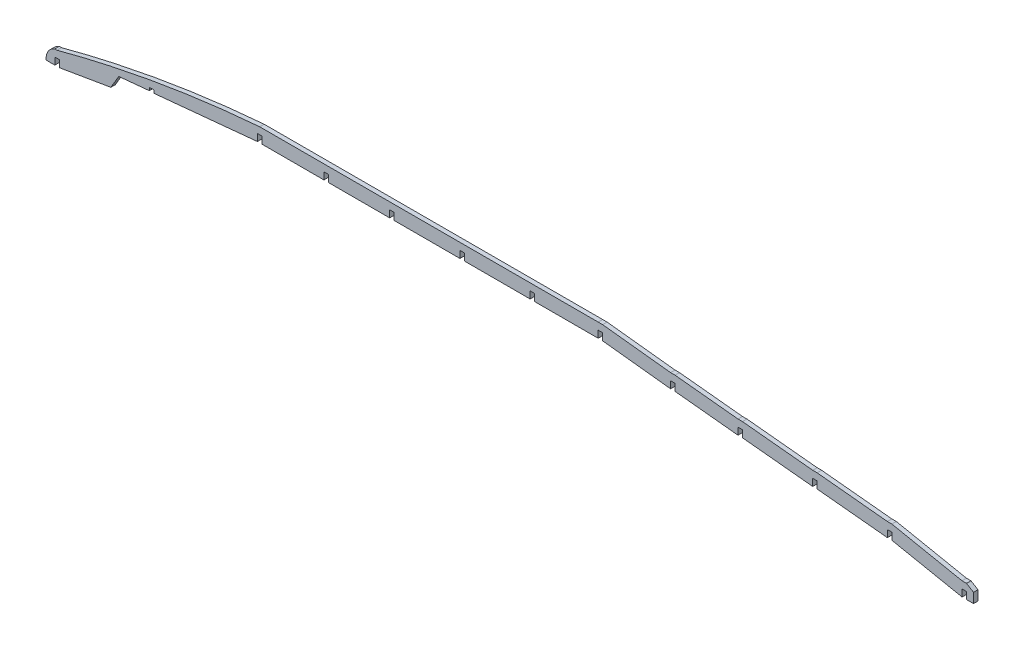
ISO-10303-21;
HEADER;
FILE_DESCRIPTION(('STEP AP214'),'2;1');
FILE_NAME('part.step','',(''),(''),'','','');
FILE_SCHEMA(('AUTOMOTIVE_DESIGN { 1 0 10303 214 1 1 1 1 }'));
ENDSEC;
DATA;
#1=APPLICATION_CONTEXT('core data for automotive mechanical design processes');
#2=APPLICATION_PROTOCOL_DEFINITION('international standard','automotive_design',2000,#1);
#3=PRODUCT_CONTEXT('',#1,'mechanical');
#4=PRODUCT('Part','Part','',(#3));
#5=PRODUCT_RELATED_PRODUCT_CATEGORY('part','',(#4));
#6=PRODUCT_DEFINITION_FORMATION('','',#4);
#7=PRODUCT_DEFINITION_CONTEXT('part definition',#1,'design');
#8=PRODUCT_DEFINITION('design','',#6,#7);
#9=PRODUCT_DEFINITION_SHAPE('','',#8);
#10=(LENGTH_UNIT() NAMED_UNIT(*) SI_UNIT(.MILLI.,.METRE.));
#11=(NAMED_UNIT(*) PLANE_ANGLE_UNIT() SI_UNIT($,.RADIAN.));
#12=(NAMED_UNIT(*) SI_UNIT($,.STERADIAN.) SOLID_ANGLE_UNIT());
#13=UNCERTAINTY_MEASURE_WITH_UNIT(LENGTH_MEASURE(1.E-05),#10,'distance_accuracy_value','');
#14=(GEOMETRIC_REPRESENTATION_CONTEXT(3) GLOBAL_UNCERTAINTY_ASSIGNED_CONTEXT((#13)) GLOBAL_UNIT_ASSIGNED_CONTEXT((#10,
#11,#12)) REPRESENTATION_CONTEXT('',''));
#15=CARTESIAN_POINT('',(0.,0.,0.));
#16=DIRECTION('',(0.,0.,1.));
#17=DIRECTION('',(1.,0.,0.));
#18=AXIS2_PLACEMENT_3D('',#15,#16,#17);
#19=CARTESIAN_POINT('',(0.,45.,3.175));
#20=DIRECTION('',(-1.,0.,0.));
#21=DIRECTION('',(0.,-1.,0.));
#22=AXIS2_PLACEMENT_3D('',#19,#20,#21);
#23=PLANE('',#22);
#24=DIRECTION('',(0.,1.,0.));
#25=VECTOR('',#24,1.);
#26=CARTESIAN_POINT('',(0.,45.,0.));
#27=LINE('',#26,#25);
#28=CARTESIAN_POINT('',(0.,40.,0.));
#29=VERTEX_POINT('',#28);
#30=CARTESIAN_POINT('',(0.,45.,0.));
#31=VERTEX_POINT('',#30);
#32=EDGE_CURVE('E513',#29,#31,#27,.T.);
#33=ORIENTED_EDGE('',*,*,#32,.T.);
#34=DIRECTION('',(0.,0.,-1.));
#35=VECTOR('',#34,1.);
#36=CARTESIAN_POINT('',(0.,45.,3.175));
#37=LINE('',#36,#35);
#38=CARTESIAN_POINT('',(0.,45.,3.175));
#39=VERTEX_POINT('',#38);
#40=EDGE_CURVE('E11',#39,#31,#37,.T.);
#41=ORIENTED_EDGE('',*,*,#40,.F.);
#42=DIRECTION('',(0.,1.,0.));
#43=VECTOR('',#42,1.);
#44=CARTESIAN_POINT('',(0.,45.,3.175));
#45=LINE('',#44,#43);
#46=CARTESIAN_POINT('',(0.,40.,3.175));
#47=VERTEX_POINT('',#46);
#48=EDGE_CURVE('E665',#47,#39,#45,.T.);
#49=ORIENTED_EDGE('',*,*,#48,.F.);
#50=DIRECTION('',(0.,0.,-1.));
#51=VECTOR('',#50,1.);
#52=CARTESIAN_POINT('',(0.,40.,3.175));
#53=LINE('',#52,#51);
#54=EDGE_CURVE('E509',#47,#29,#53,.T.);
#55=ORIENTED_EDGE('',*,*,#54,.T.);
#56=EDGE_LOOP('',(#33,#41,#49,#55));
#57=FACE_BOUND('',#56,.T.);
#58=ADVANCED_FACE('F33',(#57),#23,.F.);
#59=CARTESIAN_POINT('',(0.,45.,3.175));
#60=DIRECTION('',(0.,1.,0.));
#61=DIRECTION('',(0.,0.,1.));
#62=AXIS2_PLACEMENT_3D('',#59,#60,#61);
#63=PLANE('',#62);
#64=DIRECTION('',(1.,0.,0.));
#65=VECTOR('',#64,1.);
#66=CARTESIAN_POINT('',(0.,45.,0.));
#67=LINE('',#66,#65);
#68=CARTESIAN_POINT('',(3.175,45.,0.));
#69=VERTEX_POINT('',#68);
#70=EDGE_CURVE('E516',#31,#69,#67,.T.);
#71=ORIENTED_EDGE('',*,*,#70,.T.);
#72=DIRECTION('',(0.,0.,-1.));
#73=VECTOR('',#72,1.);
#74=CARTESIAN_POINT('',(3.175,45.,3.175));
#75=LINE('',#74,#73);
#76=CARTESIAN_POINT('',(3.175,45.,3.175));
#77=VERTEX_POINT('',#76);
#78=EDGE_CURVE('E41',#77,#69,#75,.T.);
#79=ORIENTED_EDGE('',*,*,#78,.F.);
#80=DIRECTION('',(1.,0.,0.));
#81=VECTOR('',#80,1.);
#82=CARTESIAN_POINT('',(0.,45.,3.175));
#83=LINE('',#82,#81);
#84=EDGE_CURVE('E284',#39,#77,#83,.T.);
#85=ORIENTED_EDGE('',*,*,#84,.F.);
#86=ORIENTED_EDGE('',*,*,#40,.T.);
#87=EDGE_LOOP('',(#71,#79,#85,#86));
#88=FACE_BOUND('',#87,.T.);
#89=ADVANCED_FACE('F1067',(#88),#63,.F.);
#90=CARTESIAN_POINT('',(3.175,45.,3.175));
#91=DIRECTION('',(1.,0.,0.));
#92=DIRECTION('',(0.,1.,0.));
#93=AXIS2_PLACEMENT_3D('',#90,#91,#92);
#94=PLANE('',#93);
#95=DIRECTION('',(0.,-1.,0.));
#96=VECTOR('',#95,1.);
#97=CARTESIAN_POINT('',(3.175,45.,0.));
#98=LINE('',#97,#96);
#99=CARTESIAN_POINT('',(3.175,40.0000000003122,0.));
#100=VERTEX_POINT('',#99);
#101=EDGE_CURVE('E518',#69,#100,#98,.T.);
#102=ORIENTED_EDGE('',*,*,#101,.T.);
#103=DIRECTION('',(0.,0.,-1.));
#104=VECTOR('',#103,1.);
#105=CARTESIAN_POINT('',(3.175,40.0000000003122,3.175));
#106=LINE('',#105,#104);
#107=CARTESIAN_POINT('',(3.175,40.0000000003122,3.175));
#108=VERTEX_POINT('',#107);
#109=EDGE_CURVE('E864',#108,#100,#106,.T.);
#110=ORIENTED_EDGE('',*,*,#109,.F.);
#111=DIRECTION('',(0.,-1.,0.));
#112=VECTOR('',#111,1.);
#113=CARTESIAN_POINT('',(3.175,45.,3.175));
#114=LINE('',#113,#112);
#115=EDGE_CURVE('E872',#77,#108,#114,.T.);
#116=ORIENTED_EDGE('',*,*,#115,.F.);
#117=ORIENTED_EDGE('',*,*,#78,.T.);
#118=EDGE_LOOP('',(#102,#110,#116,#117));
#119=FACE_BOUND('',#118,.T.);
#120=ADVANCED_FACE('F870',(#119),#94,.F.);
#121=CARTESIAN_POINT('',(3.175,40.0000000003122,3.175));
#122=DIRECTION('',(0.0995037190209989,0.995037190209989,0.));
#123=DIRECTION('',(-0.995037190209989,0.0995037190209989,0.));
#124=AXIS2_PLACEMENT_3D('',#121,#122,#123);
#125=PLANE('',#124);
#126=DIRECTION('',(0.995037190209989,-0.0995037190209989,0.));
#127=VECTOR('',#126,1.);
#128=CARTESIAN_POINT('',(3.175,40.0000000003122,0.));
#129=LINE('',#128,#127);
#130=CARTESIAN_POINT('',(53.175,35.0000000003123,0.));
#131=VERTEX_POINT('',#130);
#132=EDGE_CURVE('E520',#100,#131,#129,.T.);
#133=ORIENTED_EDGE('',*,*,#132,.T.);
#134=DIRECTION('',(0.,0.,-1.));
#135=VECTOR('',#134,1.);
#136=CARTESIAN_POINT('',(53.175,35.0000000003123,3.175));
#137=LINE('',#136,#135);
#138=CARTESIAN_POINT('',(53.175,35.0000000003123,3.175));
#139=VERTEX_POINT('',#138);
#140=EDGE_CURVE('E861',#139,#131,#137,.T.);
#141=ORIENTED_EDGE('',*,*,#140,.F.);
#142=DIRECTION('',(0.995037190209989,-0.0995037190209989,0.));
#143=VECTOR('',#142,1.);
#144=CARTESIAN_POINT('',(3.175,40.0000000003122,3.175));
#145=LINE('',#144,#143);
#146=EDGE_CURVE('E890',#108,#139,#145,.T.);
#147=ORIENTED_EDGE('',*,*,#146,.F.);
#148=ORIENTED_EDGE('',*,*,#109,.T.);
#149=EDGE_LOOP('',(#133,#141,#147,#148));
#150=FACE_BOUND('',#149,.T.);
#151=ADVANCED_FACE('F881',(#150),#125,.F.);
#152=CARTESIAN_POINT('',(53.175,40.0000000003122,3.175));
#153=DIRECTION('',(-1.,0.,0.));
#154=DIRECTION('',(0.,0.,1.));
#155=AXIS2_PLACEMENT_3D('',#152,#153,#154);
#156=PLANE('',#155);
#157=DIRECTION('',(0.,1.,0.));
#158=VECTOR('',#157,1.);
#159=CARTESIAN_POINT('',(53.175,40.0000000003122,0.));
#160=LINE('',#159,#158);
#161=CARTESIAN_POINT('',(53.175,40.0000000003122,0.));
#162=VERTEX_POINT('',#161);
#163=EDGE_CURVE('E522',#131,#162,#160,.T.);
#164=ORIENTED_EDGE('',*,*,#163,.T.);
#165=DIRECTION('',(0.,0.,-1.));
#166=VECTOR('',#165,1.);
#167=CARTESIAN_POINT('',(53.175,40.0000000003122,3.175));
#168=LINE('',#167,#166);
#169=CARTESIAN_POINT('',(53.175,40.0000000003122,3.175));
#170=VERTEX_POINT('',#169);
#171=EDGE_CURVE('E858',#170,#162,#168,.T.);
#172=ORIENTED_EDGE('',*,*,#171,.F.);
#173=DIRECTION('',(0.,1.,0.));
#174=VECTOR('',#173,1.);
#175=CARTESIAN_POINT('',(53.175,40.0000000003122,3.175));
#176=LINE('',#175,#174);
#177=EDGE_CURVE('E887',#139,#170,#176,.T.);
#178=ORIENTED_EDGE('',*,*,#177,.F.);
#179=ORIENTED_EDGE('',*,*,#140,.T.);
#180=EDGE_LOOP('',(#164,#172,#178,#179));
#181=FACE_BOUND('',#180,.T.);
#182=ADVANCED_FACE('F885',(#181),#156,.F.);
#183=CARTESIAN_POINT('',(53.175,40.0000000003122,3.175));
#184=DIRECTION('',(0.,1.,0.));
#185=DIRECTION('',(0.,0.,1.));
#186=AXIS2_PLACEMENT_3D('',#183,#184,#185);
#187=PLANE('',#186);
#188=DIRECTION('',(1.,0.,0.));
#189=VECTOR('',#188,1.);
#190=CARTESIAN_POINT('',(53.175,40.0000000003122,0.));
#191=LINE('',#190,#189);
#192=CARTESIAN_POINT('',(56.35,40.0000000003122,0.));
#193=VERTEX_POINT('',#192);
#194=EDGE_CURVE('E524',#162,#193,#191,.T.);
#195=ORIENTED_EDGE('',*,*,#194,.T.);
#196=DIRECTION('',(0.,0.,-1.));
#197=VECTOR('',#196,1.);
#198=CARTESIAN_POINT('',(56.35,40.0000000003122,3.175));
#199=LINE('',#198,#197);
#200=CARTESIAN_POINT('',(56.35,40.0000000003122,3.175));
#201=VERTEX_POINT('',#200);
#202=EDGE_CURVE('E855',#201,#193,#199,.T.);
#203=ORIENTED_EDGE('',*,*,#202,.F.);
#204=DIRECTION('',(1.,0.,0.));
#205=VECTOR('',#204,1.);
#206=CARTESIAN_POINT('',(53.175,40.0000000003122,3.175));
#207=LINE('',#206,#205);
#208=EDGE_CURVE('E889',#170,#201,#207,.T.);
#209=ORIENTED_EDGE('',*,*,#208,.F.);
#210=ORIENTED_EDGE('',*,*,#171,.T.);
#211=EDGE_LOOP('',(#195,#203,#209,#210));
#212=FACE_BOUND('',#211,.T.);
#213=ADVANCED_FACE('F1057',(#212),#187,.F.);
#214=CARTESIAN_POINT('',(56.35,40.0000000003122,3.175));
#215=DIRECTION('',(1.,0.,0.));
#216=DIRECTION('',(0.,0.,-1.));
#217=AXIS2_PLACEMENT_3D('',#214,#215,#216);
#218=PLANE('',#217);
#219=DIRECTION('',(0.,-1.,0.));
#220=VECTOR('',#219,1.);
#221=CARTESIAN_POINT('',(56.35,40.0000000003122,0.));
#222=LINE('',#221,#220);
#223=CARTESIAN_POINT('',(56.35,35.0000000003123,0.));
#224=VERTEX_POINT('',#223);
#225=EDGE_CURVE('E526',#193,#224,#222,.T.);
#226=ORIENTED_EDGE('',*,*,#225,.T.);
#227=DIRECTION('',(0.,0.,-1.));
#228=VECTOR('',#227,1.);
#229=CARTESIAN_POINT('',(56.35,35.0000000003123,3.175));
#230=LINE('',#229,#228);
#231=CARTESIAN_POINT('',(56.35,35.0000000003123,3.175));
#232=VERTEX_POINT('',#231);
#233=EDGE_CURVE('E852',#232,#224,#230,.T.);
#234=ORIENTED_EDGE('',*,*,#233,.F.);
#235=DIRECTION('',(0.,-1.,0.));
#236=VECTOR('',#235,1.);
#237=CARTESIAN_POINT('',(56.35,40.0000000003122,3.175));
#238=LINE('',#237,#236);
#239=EDGE_CURVE('E892',#201,#232,#238,.T.);
#240=ORIENTED_EDGE('',*,*,#239,.F.);
#241=ORIENTED_EDGE('',*,*,#202,.T.);
#242=EDGE_LOOP('',(#226,#234,#240,#241));
#243=FACE_BOUND('',#242,.T.);
#244=ADVANCED_FACE('F1053',(#243),#218,.F.);
#245=CARTESIAN_POINT('',(56.35,35.0000000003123,3.175));
#246=DIRECTION('',(0.0995037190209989,0.995037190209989,0.));
#247=DIRECTION('',(-0.995037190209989,0.0995037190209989,0.));
#248=AXIS2_PLACEMENT_3D('',#245,#246,#247);
#249=PLANE('',#248);
#250=DIRECTION('',(0.995037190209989,-0.0995037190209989,0.));
#251=VECTOR('',#250,1.);
#252=CARTESIAN_POINT('',(56.35,35.0000000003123,0.));
#253=LINE('',#252,#251);
#254=CARTESIAN_POINT('',(106.35,30.0000000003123,0.));
#255=VERTEX_POINT('',#254);
#256=EDGE_CURVE('E528',#224,#255,#253,.T.);
#257=ORIENTED_EDGE('',*,*,#256,.T.);
#258=DIRECTION('',(0.,0.,-1.));
#259=VECTOR('',#258,1.);
#260=CARTESIAN_POINT('',(106.35,30.0000000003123,3.175));
#261=LINE('',#260,#259);
#262=CARTESIAN_POINT('',(106.35,30.0000000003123,3.175));
#263=VERTEX_POINT('',#262);
#264=EDGE_CURVE('E849',#263,#255,#261,.T.);
#265=ORIENTED_EDGE('',*,*,#264,.F.);
#266=DIRECTION('',(0.995037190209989,-0.0995037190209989,0.));
#267=VECTOR('',#266,1.);
#268=CARTESIAN_POINT('',(56.35,35.0000000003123,3.175));
#269=LINE('',#268,#267);
#270=EDGE_CURVE('E898',#232,#263,#269,.T.);
#271=ORIENTED_EDGE('',*,*,#270,.F.);
#272=ORIENTED_EDGE('',*,*,#233,.T.);
#273=EDGE_LOOP('',(#257,#265,#271,#272));
#274=FACE_BOUND('',#273,.T.);
#275=ADVANCED_FACE('F1049',(#274),#249,.F.);
#276=CARTESIAN_POINT('',(106.35,30.0000000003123,3.175));
#277=DIRECTION('',(-1.,0.,0.));
#278=DIRECTION('',(0.,0.,1.));
#279=AXIS2_PLACEMENT_3D('',#276,#277,#278);
#280=PLANE('',#279);
#281=DIRECTION('',(0.,1.,0.));
#282=VECTOR('',#281,1.);
#283=CARTESIAN_POINT('',(106.35,30.0000000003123,0.));
#284=LINE('',#283,#282);
#285=CARTESIAN_POINT('',(106.35,35.0000000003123,0.));
#286=VERTEX_POINT('',#285);
#287=EDGE_CURVE('E530',#255,#286,#284,.T.);
#288=ORIENTED_EDGE('',*,*,#287,.T.);
#289=DIRECTION('',(0.,0.,-1.));
#290=VECTOR('',#289,1.);
#291=CARTESIAN_POINT('',(106.35,35.0000000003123,3.175));
#292=LINE('',#291,#290);
#293=CARTESIAN_POINT('',(106.35,35.0000000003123,3.175));
#294=VERTEX_POINT('',#293);
#295=EDGE_CURVE('E846',#294,#286,#292,.T.);
#296=ORIENTED_EDGE('',*,*,#295,.F.);
#297=DIRECTION('',(0.,1.,0.));
#298=VECTOR('',#297,1.);
#299=CARTESIAN_POINT('',(106.35,30.0000000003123,3.175));
#300=LINE('',#299,#298);
#301=EDGE_CURVE('E900',#263,#294,#300,.T.);
#302=ORIENTED_EDGE('',*,*,#301,.F.);
#303=ORIENTED_EDGE('',*,*,#264,.T.);
#304=EDGE_LOOP('',(#288,#296,#302,#303));
#305=FACE_BOUND('',#304,.T.);
#306=ADVANCED_FACE('F1045',(#305),#280,.F.);
#307=CARTESIAN_POINT('',(106.35,35.0000000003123,3.175));
#308=DIRECTION('',(0.,1.,0.));
#309=DIRECTION('',(0.,0.,1.));
#310=AXIS2_PLACEMENT_3D('',#307,#308,#309);
#311=PLANE('',#310);
#312=DIRECTION('',(1.,0.,0.));
#313=VECTOR('',#312,1.);
#314=CARTESIAN_POINT('',(106.35,35.0000000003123,0.));
#315=LINE('',#314,#313);
#316=CARTESIAN_POINT('',(109.525,35.0000000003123,0.));
#317=VERTEX_POINT('',#316);
#318=EDGE_CURVE('E532',#286,#317,#315,.T.);
#319=ORIENTED_EDGE('',*,*,#318,.T.);
#320=DIRECTION('',(0.,0.,-1.));
#321=VECTOR('',#320,1.);
#322=CARTESIAN_POINT('',(109.525,35.0000000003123,3.175));
#323=LINE('',#322,#321);
#324=CARTESIAN_POINT('',(109.525,35.0000000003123,3.175));
#325=VERTEX_POINT('',#324);
#326=EDGE_CURVE('E843',#325,#317,#323,.T.);
#327=ORIENTED_EDGE('',*,*,#326,.F.);
#328=DIRECTION('',(1.,0.,0.));
#329=VECTOR('',#328,1.);
#330=CARTESIAN_POINT('',(106.35,35.0000000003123,3.175));
#331=LINE('',#330,#329);
#332=EDGE_CURVE('E902',#294,#325,#331,.T.);
#333=ORIENTED_EDGE('',*,*,#332,.F.);
#334=ORIENTED_EDGE('',*,*,#295,.T.);
#335=EDGE_LOOP('',(#319,#327,#333,#334));
#336=FACE_BOUND('',#335,.T.);
#337=ADVANCED_FACE('F1041',(#336),#311,.F.);
#338=CARTESIAN_POINT('',(109.525,35.0000000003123,3.175));
#339=DIRECTION('',(1.,0.,0.));
#340=DIRECTION('',(0.,0.,-1.));
#341=AXIS2_PLACEMENT_3D('',#338,#339,#340);
#342=PLANE('',#341);
#343=DIRECTION('',(0.,-1.,0.));
#344=VECTOR('',#343,1.);
#345=CARTESIAN_POINT('',(109.525,35.0000000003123,0.));
#346=LINE('',#345,#344);
#347=CARTESIAN_POINT('',(109.525,30.0000000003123,0.));
#348=VERTEX_POINT('',#347);
#349=EDGE_CURVE('E534',#317,#348,#346,.T.);
#350=ORIENTED_EDGE('',*,*,#349,.T.);
#351=DIRECTION('',(0.,0.,-1.));
#352=VECTOR('',#351,1.);
#353=CARTESIAN_POINT('',(109.525,30.0000000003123,3.175));
#354=LINE('',#353,#352);
#355=CARTESIAN_POINT('',(109.525,30.0000000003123,3.175));
#356=VERTEX_POINT('',#355);
#357=EDGE_CURVE('E840',#356,#348,#354,.T.);
#358=ORIENTED_EDGE('',*,*,#357,.F.);
#359=DIRECTION('',(0.,-1.,0.));
#360=VECTOR('',#359,1.);
#361=CARTESIAN_POINT('',(109.525,35.0000000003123,3.175));
#362=LINE('',#361,#360);
#363=EDGE_CURVE('E904',#325,#356,#362,.T.);
#364=ORIENTED_EDGE('',*,*,#363,.F.);
#365=ORIENTED_EDGE('',*,*,#326,.T.);
#366=EDGE_LOOP('',(#350,#358,#364,#365));
#367=FACE_BOUND('',#366,.T.);
#368=ADVANCED_FACE('F1037',(#367),#342,.F.);
#369=CARTESIAN_POINT('',(109.525,30.0000000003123,3.175));
#370=DIRECTION('',(0.196116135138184,0.98058067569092,0.));
#371=DIRECTION('',(-0.98058067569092,0.196116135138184,0.));
#372=AXIS2_PLACEMENT_3D('',#369,#370,#371);
#373=PLANE('',#372);
#374=DIRECTION('',(0.98058067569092,-0.196116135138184,0.));
#375=VECTOR('',#374,1.);
#376=CARTESIAN_POINT('',(109.525,30.0000000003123,0.));
#377=LINE('',#376,#375);
#378=CARTESIAN_POINT('',(159.525,20.0000000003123,0.));
#379=VERTEX_POINT('',#378);
#380=EDGE_CURVE('E536',#348,#379,#377,.T.);
#381=ORIENTED_EDGE('',*,*,#380,.T.);
#382=DIRECTION('',(0.,0.,-1.));
#383=VECTOR('',#382,1.);
#384=CARTESIAN_POINT('',(159.525,20.0000000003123,3.175));
#385=LINE('',#384,#383);
#386=CARTESIAN_POINT('',(159.525,20.0000000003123,3.175));
#387=VERTEX_POINT('',#386);
#388=EDGE_CURVE('E837',#387,#379,#385,.T.);
#389=ORIENTED_EDGE('',*,*,#388,.F.);
#390=DIRECTION('',(0.98058067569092,-0.196116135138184,0.));
#391=VECTOR('',#390,1.);
#392=CARTESIAN_POINT('',(109.525,30.0000000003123,3.175));
#393=LINE('',#392,#391);
#394=EDGE_CURVE('E906',#356,#387,#393,.T.);
#395=ORIENTED_EDGE('',*,*,#394,.F.);
#396=ORIENTED_EDGE('',*,*,#357,.T.);
#397=EDGE_LOOP('',(#381,#389,#395,#396));
#398=FACE_BOUND('',#397,.T.);
#399=ADVANCED_FACE('F1033',(#398),#373,.F.);
#400=CARTESIAN_POINT('',(159.525,20.0000000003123,3.175));
#401=DIRECTION('',(-1.,0.,0.));
#402=DIRECTION('',(0.,0.,1.));
#403=AXIS2_PLACEMENT_3D('',#400,#401,#402);
#404=PLANE('',#403);
#405=DIRECTION('',(0.,1.,0.));
#406=VECTOR('',#405,1.);
#407=CARTESIAN_POINT('',(159.525,20.0000000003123,0.));
#408=LINE('',#407,#406);
#409=CARTESIAN_POINT('',(159.525,25.0000000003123,0.));
#410=VERTEX_POINT('',#409);
#411=EDGE_CURVE('E538',#379,#410,#408,.T.);
#412=ORIENTED_EDGE('',*,*,#411,.T.);
#413=DIRECTION('',(0.,0.,-1.));
#414=VECTOR('',#413,1.);
#415=CARTESIAN_POINT('',(159.525,25.0000000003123,3.175));
#416=LINE('',#415,#414);
#417=CARTESIAN_POINT('',(159.525,25.0000000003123,3.175));
#418=VERTEX_POINT('',#417);
#419=EDGE_CURVE('E834',#418,#410,#416,.T.);
#420=ORIENTED_EDGE('',*,*,#419,.F.);
#421=DIRECTION('',(0.,1.,0.));
#422=VECTOR('',#421,1.);
#423=CARTESIAN_POINT('',(159.525,20.0000000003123,3.175));
#424=LINE('',#423,#422);
#425=EDGE_CURVE('E908',#387,#418,#424,.T.);
#426=ORIENTED_EDGE('',*,*,#425,.F.);
#427=ORIENTED_EDGE('',*,*,#388,.T.);
#428=EDGE_LOOP('',(#412,#420,#426,#427));
#429=FACE_BOUND('',#428,.T.);
#430=ADVANCED_FACE('F1029',(#429),#404,.F.);
#431=CARTESIAN_POINT('',(159.525,25.0000000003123,3.175));
#432=DIRECTION('',(0.,1.,0.));
#433=DIRECTION('',(0.,0.,1.));
#434=AXIS2_PLACEMENT_3D('',#431,#432,#433);
#435=PLANE('',#434);
#436=DIRECTION('',(1.,0.,0.));
#437=VECTOR('',#436,1.);
#438=CARTESIAN_POINT('',(159.525,25.0000000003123,0.));
#439=LINE('',#438,#437);
#440=CARTESIAN_POINT('',(162.7,25.0000000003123,0.));
#441=VERTEX_POINT('',#440);
#442=EDGE_CURVE('E540',#410,#441,#439,.T.);
#443=ORIENTED_EDGE('',*,*,#442,.T.);
#444=DIRECTION('',(0.,0.,-1.));
#445=VECTOR('',#444,1.);
#446=CARTESIAN_POINT('',(162.7,25.0000000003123,3.175));
#447=LINE('',#446,#445);
#448=CARTESIAN_POINT('',(162.7,25.0000000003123,3.175));
#449=VERTEX_POINT('',#448);
#450=EDGE_CURVE('E831',#449,#441,#447,.T.);
#451=ORIENTED_EDGE('',*,*,#450,.F.);
#452=DIRECTION('',(1.,0.,0.));
#453=VECTOR('',#452,1.);
#454=CARTESIAN_POINT('',(159.525,25.0000000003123,3.175));
#455=LINE('',#454,#453);
#456=EDGE_CURVE('E910',#418,#449,#455,.T.);
#457=ORIENTED_EDGE('',*,*,#456,.F.);
#458=ORIENTED_EDGE('',*,*,#419,.T.);
#459=EDGE_LOOP('',(#443,#451,#457,#458));
#460=FACE_BOUND('',#459,.T.);
#461=ADVANCED_FACE('F1025',(#460),#435,.F.);
#462=CARTESIAN_POINT('',(162.7,25.0000000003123,3.175));
#463=DIRECTION('',(1.,0.,0.));
#464=DIRECTION('',(0.,0.,-1.));
#465=AXIS2_PLACEMENT_3D('',#462,#463,#464);
#466=PLANE('',#465);
#467=DIRECTION('',(0.,-1.,0.));
#468=VECTOR('',#467,1.);
#469=CARTESIAN_POINT('',(162.7,25.0000000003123,0.));
#470=LINE('',#469,#468);
#471=CARTESIAN_POINT('',(162.7,20.0000000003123,0.));
#472=VERTEX_POINT('',#471);
#473=EDGE_CURVE('E542',#441,#472,#470,.T.);
#474=ORIENTED_EDGE('',*,*,#473,.T.);
#475=DIRECTION('',(0.,0.,-1.));
#476=VECTOR('',#475,1.);
#477=CARTESIAN_POINT('',(162.7,20.0000000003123,3.175));
#478=LINE('',#477,#476);
#479=CARTESIAN_POINT('',(162.7,20.0000000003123,3.175));
#480=VERTEX_POINT('',#479);
#481=EDGE_CURVE('E828',#480,#472,#478,.T.);
#482=ORIENTED_EDGE('',*,*,#481,.F.);
#483=DIRECTION('',(0.,-1.,0.));
#484=VECTOR('',#483,1.);
#485=CARTESIAN_POINT('',(162.7,25.0000000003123,3.175));
#486=LINE('',#485,#484);
#487=EDGE_CURVE('E912',#449,#480,#486,.T.);
#488=ORIENTED_EDGE('',*,*,#487,.F.);
#489=ORIENTED_EDGE('',*,*,#450,.T.);
#490=EDGE_LOOP('',(#474,#482,#488,#489));
#491=FACE_BOUND('',#490,.T.);
#492=ADVANCED_FACE('F1021',(#491),#466,.F.);
#493=CARTESIAN_POINT('',(162.7,20.0000000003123,3.175));
#494=DIRECTION('',(0.,1.,0.));
#495=DIRECTION('',(-1.,0.,0.));
#496=AXIS2_PLACEMENT_3D('',#493,#494,#495);
#497=PLANE('',#496);
#498=DIRECTION('',(1.,0.,0.));
#499=VECTOR('',#498,1.);
#500=CARTESIAN_POINT('',(162.7,20.0000000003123,0.));
#501=LINE('',#500,#499);
#502=CARTESIAN_POINT('',(167.7,20.0000000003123,0.));
#503=VERTEX_POINT('',#502);
#504=EDGE_CURVE('E544',#472,#503,#501,.T.);
#505=ORIENTED_EDGE('',*,*,#504,.T.);
#506=DIRECTION('',(0.,0.,-1.));
#507=VECTOR('',#506,1.);
#508=CARTESIAN_POINT('',(167.7,20.0000000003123,3.175));
#509=LINE('',#508,#507);
#510=CARTESIAN_POINT('',(167.7,20.0000000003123,3.175));
#511=VERTEX_POINT('',#510);
#512=EDGE_CURVE('E825',#511,#503,#509,.T.);
#513=ORIENTED_EDGE('',*,*,#512,.F.);
#514=DIRECTION('',(1.,0.,0.));
#515=VECTOR('',#514,1.);
#516=CARTESIAN_POINT('',(162.7,20.0000000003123,3.175));
#517=LINE('',#516,#515);
#518=EDGE_CURVE('E914',#480,#511,#517,.T.);
#519=ORIENTED_EDGE('',*,*,#518,.F.);
#520=ORIENTED_EDGE('',*,*,#481,.T.);
#521=EDGE_LOOP('',(#505,#513,#519,#520));
#522=FACE_BOUND('',#521,.T.);
#523=ADVANCED_FACE('F1017',(#522),#497,.F.);
#524=CARTESIAN_POINT('',(167.7,20.0000000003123,3.175));
#525=DIRECTION('',(-1.,0.,0.));
#526=DIRECTION('',(0.,0.,1.));
#527=AXIS2_PLACEMENT_3D('',#524,#525,#526);
#528=PLANE('',#527);
#529=DIRECTION('',(0.,1.,0.));
#530=VECTOR('',#529,1.);
#531=CARTESIAN_POINT('',(167.7,20.0000000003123,0.));
#532=LINE('',#531,#530);
#533=CARTESIAN_POINT('',(167.7,27.0000000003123,0.));
#534=VERTEX_POINT('',#533);
#535=EDGE_CURVE('E546',#503,#534,#532,.T.);
#536=ORIENTED_EDGE('',*,*,#535,.T.);
#537=DIRECTION('',(0.,0.,-1.));
#538=VECTOR('',#537,1.);
#539=CARTESIAN_POINT('',(167.7,27.0000000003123,3.175));
#540=LINE('',#539,#538);
#541=CARTESIAN_POINT('',(167.7,27.0000000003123,3.175));
#542=VERTEX_POINT('',#541);
#543=EDGE_CURVE('E822',#542,#534,#540,.T.);
#544=ORIENTED_EDGE('',*,*,#543,.F.);
#545=DIRECTION('',(0.,1.,0.));
#546=VECTOR('',#545,1.);
#547=CARTESIAN_POINT('',(167.7,20.0000000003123,3.175));
#548=LINE('',#547,#546);
#549=EDGE_CURVE('E916',#511,#542,#548,.T.);
#550=ORIENTED_EDGE('',*,*,#549,.F.);
#551=ORIENTED_EDGE('',*,*,#512,.T.);
#552=EDGE_LOOP('',(#536,#544,#550,#551));
#553=FACE_BOUND('',#552,.T.);
#554=ADVANCED_FACE('F1013',(#553),#528,.F.);
#555=CARTESIAN_POINT('',(162.7,30.0000000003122,3.175));
#556=DIRECTION('',(-0.514495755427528,-0.857492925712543,0.));
#557=DIRECTION('',(0.857492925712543,-0.514495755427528,0.));
#558=AXIS2_PLACEMENT_3D('',#555,#556,#557);
#559=PLANE('',#558);
#560=DIRECTION('',(-0.857492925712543,0.514495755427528,0.));
#561=VECTOR('',#560,1.);
#562=CARTESIAN_POINT('',(162.7,30.0000000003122,0.));
#563=LINE('',#562,#561);
#564=CARTESIAN_POINT('',(162.7,30.0000000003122,0.));
#565=VERTEX_POINT('',#564);
#566=EDGE_CURVE('E548',#534,#565,#563,.T.);
#567=ORIENTED_EDGE('',*,*,#566,.T.);
#568=DIRECTION('',(0.,0.,-1.));
#569=VECTOR('',#568,1.);
#570=CARTESIAN_POINT('',(162.7,30.0000000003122,3.175));
#571=LINE('',#570,#569);
#572=CARTESIAN_POINT('',(162.7,30.0000000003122,3.175));
#573=VERTEX_POINT('',#572);
#574=EDGE_CURVE('E819',#573,#565,#571,.T.);
#575=ORIENTED_EDGE('',*,*,#574,.F.);
#576=DIRECTION('',(-0.857492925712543,0.514495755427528,0.));
#577=VECTOR('',#576,1.);
#578=CARTESIAN_POINT('',(162.7,30.0000000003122,3.175));
#579=LINE('',#578,#577);
#580=EDGE_CURVE('E918',#542,#573,#579,.T.);
#581=ORIENTED_EDGE('',*,*,#580,.F.);
#582=ORIENTED_EDGE('',*,*,#543,.T.);
#583=EDGE_LOOP('',(#567,#575,#581,#582));
#584=FACE_BOUND('',#583,.T.);
#585=ADVANCED_FACE('F1009',(#584),#559,.F.);
#586=CARTESIAN_POINT('',(159.525,30.0000000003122,3.175));
#587=DIRECTION('',(0.,-1.,0.));
#588=DIRECTION('',(0.,0.,-1.));
#589=AXIS2_PLACEMENT_3D('',#586,#587,#588);
#590=PLANE('',#589);
#591=DIRECTION('',(-1.,0.,0.));
#592=VECTOR('',#591,1.);
#593=CARTESIAN_POINT('',(159.525,30.0000000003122,0.));
#594=LINE('',#593,#592);
#595=CARTESIAN_POINT('',(159.525,30.0000000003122,0.));
#596=VERTEX_POINT('',#595);
#597=EDGE_CURVE('E550',#565,#596,#594,.T.);
#598=ORIENTED_EDGE('',*,*,#597,.T.);
#599=DIRECTION('',(0.,0.,-1.));
#600=VECTOR('',#599,1.);
#601=CARTESIAN_POINT('',(159.525,30.0000000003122,3.175));
#602=LINE('',#601,#600);
#603=CARTESIAN_POINT('',(159.525,30.0000000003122,3.175));
#604=VERTEX_POINT('',#603);
#605=EDGE_CURVE('E816',#604,#596,#602,.T.);
#606=ORIENTED_EDGE('',*,*,#605,.F.);
#607=DIRECTION('',(-1.,0.,0.));
#608=VECTOR('',#607,1.);
#609=CARTESIAN_POINT('',(159.525,30.0000000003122,3.175));
#610=LINE('',#609,#608);
#611=EDGE_CURVE('E920',#573,#604,#610,.T.);
#612=ORIENTED_EDGE('',*,*,#611,.F.);
#613=ORIENTED_EDGE('',*,*,#574,.T.);
#614=EDGE_LOOP('',(#598,#606,#612,#613));
#615=FACE_BOUND('',#614,.T.);
#616=ADVANCED_FACE('F1005',(#615),#590,.F.);
#617=CARTESIAN_POINT('',(109.525,40.0000000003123,3.175));
#618=DIRECTION('',(-0.196116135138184,-0.98058067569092,0.));
#619=DIRECTION('',(0.98058067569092,-0.196116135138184,0.));
#620=AXIS2_PLACEMENT_3D('',#617,#618,#619);
#621=PLANE('',#620);
#622=DIRECTION('',(-0.98058067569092,0.196116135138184,0.));
#623=VECTOR('',#622,1.);
#624=CARTESIAN_POINT('',(109.525,40.0000000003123,0.));
#625=LINE('',#624,#623);
#626=CARTESIAN_POINT('',(109.525,40.0000000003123,0.));
#627=VERTEX_POINT('',#626);
#628=EDGE_CURVE('E552',#596,#627,#625,.T.);
#629=ORIENTED_EDGE('',*,*,#628,.T.);
#630=DIRECTION('',(0.,0.,-1.));
#631=VECTOR('',#630,1.);
#632=CARTESIAN_POINT('',(109.525,40.0000000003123,3.175));
#633=LINE('',#632,#631);
#634=CARTESIAN_POINT('',(109.525,40.0000000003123,3.175));
#635=VERTEX_POINT('',#634);
#636=EDGE_CURVE('E813',#635,#627,#633,.T.);
#637=ORIENTED_EDGE('',*,*,#636,.F.);
#638=DIRECTION('',(-0.98058067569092,0.196116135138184,0.));
#639=VECTOR('',#638,1.);
#640=CARTESIAN_POINT('',(109.525,40.0000000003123,3.175));
#641=LINE('',#640,#639);
#642=EDGE_CURVE('E922',#604,#635,#641,.T.);
#643=ORIENTED_EDGE('',*,*,#642,.F.);
#644=ORIENTED_EDGE('',*,*,#605,.T.);
#645=EDGE_LOOP('',(#629,#637,#643,#644));
#646=FACE_BOUND('',#645,.T.);
#647=ADVANCED_FACE('F1001',(#646),#621,.F.);
#648=CARTESIAN_POINT('',(106.35,40.0000000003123,3.175));
#649=DIRECTION('',(0.,-1.,0.));
#650=DIRECTION('',(0.,0.,-1.));
#651=AXIS2_PLACEMENT_3D('',#648,#649,#650);
#652=PLANE('',#651);
#653=DIRECTION('',(-1.,0.,0.));
#654=VECTOR('',#653,1.);
#655=CARTESIAN_POINT('',(106.35,40.0000000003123,0.));
#656=LINE('',#655,#654);
#657=CARTESIAN_POINT('',(106.35,40.0000000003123,0.));
#658=VERTEX_POINT('',#657);
#659=EDGE_CURVE('E554',#627,#658,#656,.T.);
#660=ORIENTED_EDGE('',*,*,#659,.T.);
#661=DIRECTION('',(0.,0.,-1.));
#662=VECTOR('',#661,1.);
#663=CARTESIAN_POINT('',(106.35,40.0000000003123,3.175));
#664=LINE('',#663,#662);
#665=CARTESIAN_POINT('',(106.35,40.0000000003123,3.175));
#666=VERTEX_POINT('',#665);
#667=EDGE_CURVE('E810',#666,#658,#664,.T.);
#668=ORIENTED_EDGE('',*,*,#667,.F.);
#669=DIRECTION('',(-1.,0.,0.));
#670=VECTOR('',#669,1.);
#671=CARTESIAN_POINT('',(106.35,40.0000000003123,3.175));
#672=LINE('',#671,#670);
#673=EDGE_CURVE('E924',#635,#666,#672,.T.);
#674=ORIENTED_EDGE('',*,*,#673,.F.);
#675=ORIENTED_EDGE('',*,*,#636,.T.);
#676=EDGE_LOOP('',(#660,#668,#674,#675));
#677=FACE_BOUND('',#676,.T.);
#678=ADVANCED_FACE('F997',(#677),#652,.F.);
#679=CARTESIAN_POINT('',(56.35,45.0000000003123,3.175));
#680=DIRECTION('',(-0.0995037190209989,-0.995037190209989,0.));
#681=DIRECTION('',(0.995037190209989,-0.0995037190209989,0.));
#682=AXIS2_PLACEMENT_3D('',#679,#680,#681);
#683=PLANE('',#682);
#684=DIRECTION('',(-0.995037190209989,0.0995037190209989,0.));
#685=VECTOR('',#684,1.);
#686=CARTESIAN_POINT('',(56.35,45.0000000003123,0.));
#687=LINE('',#686,#685);
#688=CARTESIAN_POINT('',(56.35,45.0000000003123,0.));
#689=VERTEX_POINT('',#688);
#690=EDGE_CURVE('E556',#658,#689,#687,.T.);
#691=ORIENTED_EDGE('',*,*,#690,.T.);
#692=DIRECTION('',(0.,0.,-1.));
#693=VECTOR('',#692,1.);
#694=CARTESIAN_POINT('',(56.35,45.0000000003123,3.175));
#695=LINE('',#694,#693);
#696=CARTESIAN_POINT('',(56.35,45.0000000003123,3.175));
#697=VERTEX_POINT('',#696);
#698=EDGE_CURVE('E807',#697,#689,#695,.T.);
#699=ORIENTED_EDGE('',*,*,#698,.F.);
#700=DIRECTION('',(-0.995037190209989,0.0995037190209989,0.));
#701=VECTOR('',#700,1.);
#702=CARTESIAN_POINT('',(56.35,45.0000000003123,3.175));
#703=LINE('',#702,#701);
#704=EDGE_CURVE('E926',#666,#697,#703,.T.);
#705=ORIENTED_EDGE('',*,*,#704,.F.);
#706=ORIENTED_EDGE('',*,*,#667,.T.);
#707=EDGE_LOOP('',(#691,#699,#705,#706));
#708=FACE_BOUND('',#707,.T.);
#709=ADVANCED_FACE('F993',(#708),#683,.F.);
#710=CARTESIAN_POINT('',(53.175,45.0000000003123,3.175));
#711=DIRECTION('',(0.,-1.,0.));
#712=DIRECTION('',(0.,0.,-1.));
#713=AXIS2_PLACEMENT_3D('',#710,#711,#712);
#714=PLANE('',#713);
#715=DIRECTION('',(-1.,0.,0.));
#716=VECTOR('',#715,1.);
#717=CARTESIAN_POINT('',(53.175,45.0000000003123,0.));
#718=LINE('',#717,#716);
#719=CARTESIAN_POINT('',(53.175,45.0000000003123,0.));
#720=VERTEX_POINT('',#719);
#721=EDGE_CURVE('E558',#689,#720,#718,.T.);
#722=ORIENTED_EDGE('',*,*,#721,.T.);
#723=DIRECTION('',(0.,0.,-1.));
#724=VECTOR('',#723,1.);
#725=CARTESIAN_POINT('',(53.175,45.0000000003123,3.175));
#726=LINE('',#725,#724);
#727=CARTESIAN_POINT('',(53.175,45.0000000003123,3.175));
#728=VERTEX_POINT('',#727);
#729=EDGE_CURVE('E804',#728,#720,#726,.T.);
#730=ORIENTED_EDGE('',*,*,#729,.F.);
#731=DIRECTION('',(-1.,0.,0.));
#732=VECTOR('',#731,1.);
#733=CARTESIAN_POINT('',(53.175,45.0000000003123,3.175));
#734=LINE('',#733,#732);
#735=EDGE_CURVE('E928',#697,#728,#734,.T.);
#736=ORIENTED_EDGE('',*,*,#735,.F.);
#737=ORIENTED_EDGE('',*,*,#698,.T.);
#738=EDGE_LOOP('',(#722,#730,#736,#737));
#739=FACE_BOUND('',#738,.T.);
#740=ADVANCED_FACE('F989',(#739),#714,.F.);
#741=CARTESIAN_POINT('',(3.175,50.0000000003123,3.175));
#742=DIRECTION('',(-0.0995037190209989,-0.995037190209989,0.));
#743=DIRECTION('',(0.995037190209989,-0.0995037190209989,0.));
#744=AXIS2_PLACEMENT_3D('',#741,#742,#743);
#745=PLANE('',#744);
#746=DIRECTION('',(-0.995037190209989,0.0995037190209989,0.));
#747=VECTOR('',#746,1.);
#748=CARTESIAN_POINT('',(3.175,50.0000000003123,0.));
#749=LINE('',#748,#747);
#750=CARTESIAN_POINT('',(3.175,50.0000000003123,0.));
#751=VERTEX_POINT('',#750);
#752=EDGE_CURVE('E560',#720,#751,#749,.T.);
#753=ORIENTED_EDGE('',*,*,#752,.T.);
#754=DIRECTION('',(0.,0.,-1.));
#755=VECTOR('',#754,1.);
#756=CARTESIAN_POINT('',(3.175,50.0000000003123,3.175));
#757=LINE('',#756,#755);
#758=CARTESIAN_POINT('',(3.175,50.0000000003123,3.175));
#759=VERTEX_POINT('',#758);
#760=EDGE_CURVE('E801',#759,#751,#757,.T.);
#761=ORIENTED_EDGE('',*,*,#760,.F.);
#762=DIRECTION('',(-0.995037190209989,0.0995037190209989,0.));
#763=VECTOR('',#762,1.);
#764=CARTESIAN_POINT('',(3.175,50.0000000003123,3.175));
#765=LINE('',#764,#763);
#766=EDGE_CURVE('E930',#728,#759,#765,.T.);
#767=ORIENTED_EDGE('',*,*,#766,.F.);
#768=ORIENTED_EDGE('',*,*,#729,.T.);
#769=EDGE_LOOP('',(#753,#761,#767,#768));
#770=FACE_BOUND('',#769,.T.);
#771=ADVANCED_FACE('F985',(#770),#745,.F.);
#772=CARTESIAN_POINT('',(0.,50.0000000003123,3.175));
#773=DIRECTION('',(0.,-1.,0.));
#774=DIRECTION('',(0.,0.,-1.));
#775=AXIS2_PLACEMENT_3D('',#772,#773,#774);
#776=PLANE('',#775);
#777=DIRECTION('',(-1.,0.,0.));
#778=VECTOR('',#777,1.);
#779=CARTESIAN_POINT('',(0.,50.0000000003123,0.));
#780=LINE('',#779,#778);
#781=CARTESIAN_POINT('',(0.,50.0000000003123,0.));
#782=VERTEX_POINT('',#781);
#783=EDGE_CURVE('E562',#751,#782,#780,.T.);
#784=ORIENTED_EDGE('',*,*,#783,.T.);
#785=DIRECTION('',(0.,0.,-1.));
#786=VECTOR('',#785,1.);
#787=CARTESIAN_POINT('',(0.,50.0000000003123,3.175));
#788=LINE('',#787,#786);
#789=CARTESIAN_POINT('',(0.,50.0000000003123,3.175));
#790=VERTEX_POINT('',#789);
#791=EDGE_CURVE('E798',#790,#782,#788,.T.);
#792=ORIENTED_EDGE('',*,*,#791,.F.);
#793=DIRECTION('',(-1.,0.,0.));
#794=VECTOR('',#793,1.);
#795=CARTESIAN_POINT('',(0.,50.0000000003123,3.175));
#796=LINE('',#795,#794);
#797=EDGE_CURVE('E932',#759,#790,#796,.T.);
#798=ORIENTED_EDGE('',*,*,#797,.F.);
#799=ORIENTED_EDGE('',*,*,#760,.T.);
#800=EDGE_LOOP('',(#784,#792,#798,#799));
#801=FACE_BOUND('',#800,.T.);
#802=ADVANCED_FACE('F981',(#801),#776,.F.);
#803=CARTESIAN_POINT('',(0.,50.0000000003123,3.175));
#804=DIRECTION('',(-0.102382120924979,-0.994745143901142,0.));
#805=DIRECTION('',(0.994745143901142,-0.102382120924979,0.));
#806=AXIS2_PLACEMENT_3D('',#803,#804,#805);
#807=PLANE('',#806);
#808=DIRECTION('',(-0.994745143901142,0.102382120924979,0.));
#809=VECTOR('',#808,1.);
#810=CARTESIAN_POINT('',(0.,50.0000000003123,0.));
#811=LINE('',#810,#809);
#812=CARTESIAN_POINT('',(-44.81,54.6119781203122,0.));
#813=VERTEX_POINT('',#812);
#814=EDGE_CURVE('E564',#782,#813,#811,.T.);
#815=ORIENTED_EDGE('',*,*,#814,.T.);
#816=DIRECTION('',(0.,0.,-1.));
#817=VECTOR('',#816,1.);
#818=CARTESIAN_POINT('',(-44.81,54.6119781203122,3.175));
#819=LINE('',#818,#817);
#820=CARTESIAN_POINT('',(-44.81,54.6119781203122,3.175));
#821=VERTEX_POINT('',#820);
#822=EDGE_CURVE('E795',#821,#813,#819,.T.);
#823=ORIENTED_EDGE('',*,*,#822,.F.);
#824=DIRECTION('',(-0.994745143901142,0.102382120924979,0.));
#825=VECTOR('',#824,1.);
#826=CARTESIAN_POINT('',(0.,50.0000000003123,3.175));
#827=LINE('',#826,#825);
#828=EDGE_CURVE('E934',#790,#821,#827,.T.);
#829=ORIENTED_EDGE('',*,*,#828,.F.);
#830=ORIENTED_EDGE('',*,*,#791,.T.);
#831=EDGE_LOOP('',(#815,#823,#829,#830));
#832=FACE_BOUND('',#831,.T.);
#833=ADVANCED_FACE('F977',(#832),#807,.F.);
#834=CARTESIAN_POINT('',(-44.81,54.6119781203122,3.175));
#835=DIRECTION('',(0.,-1.,0.));
#836=DIRECTION('',(0.,0.,-1.));
#837=AXIS2_PLACEMENT_3D('',#834,#835,#836);
#838=PLANE('',#837);
#839=DIRECTION('',(-1.,0.,0.));
#840=VECTOR('',#839,1.);
#841=CARTESIAN_POINT('',(-44.81,54.6119781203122,0.));
#842=LINE('',#841,#840);
#843=CARTESIAN_POINT('',(-47.985,54.6119781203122,0.));
#844=VERTEX_POINT('',#843);
#845=EDGE_CURVE('E566',#813,#844,#842,.T.);
#846=ORIENTED_EDGE('',*,*,#845,.T.);
#847=DIRECTION('',(0.,0.,-1.));
#848=VECTOR('',#847,1.);
#849=CARTESIAN_POINT('',(-47.985,54.6119781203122,3.175));
#850=LINE('',#849,#848);
#851=CARTESIAN_POINT('',(-47.985,54.6119781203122,3.175));
#852=VERTEX_POINT('',#851);
#853=EDGE_CURVE('E792',#852,#844,#850,.T.);
#854=ORIENTED_EDGE('',*,*,#853,.F.);
#855=DIRECTION('',(-1.,0.,0.));
#856=VECTOR('',#855,1.);
#857=CARTESIAN_POINT('',(-44.81,54.6119781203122,3.175));
#858=LINE('',#857,#856);
#859=EDGE_CURVE('E936',#821,#852,#858,.T.);
#860=ORIENTED_EDGE('',*,*,#859,.F.);
#861=ORIENTED_EDGE('',*,*,#822,.T.);
#862=EDGE_LOOP('',(#846,#854,#860,#861));
#863=FACE_BOUND('',#862,.T.);
#864=ADVANCED_FACE('F973',(#863),#838,.F.);
#865=CARTESIAN_POINT('',(-47.985,54.6119781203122,3.175));
#866=DIRECTION('',(-0.110616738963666,-0.993863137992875,0.));
#867=DIRECTION('',(0.993863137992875,-0.110616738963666,0.));
#868=AXIS2_PLACEMENT_3D('',#865,#866,#867);
#869=PLANE('',#868);
#870=DIRECTION('',(-0.993863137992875,0.110616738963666,0.));
#871=VECTOR('',#870,1.);
#872=CARTESIAN_POINT('',(-47.985,54.6119781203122,0.));
#873=LINE('',#872,#871);
#874=CARTESIAN_POINT('',(-96.395,60.0000000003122,0.));
#875=VERTEX_POINT('',#874);
#876=EDGE_CURVE('E568',#844,#875,#873,.T.);
#877=ORIENTED_EDGE('',*,*,#876,.T.);
#878=DIRECTION('',(0.,0.,-1.));
#879=VECTOR('',#878,1.);
#880=CARTESIAN_POINT('',(-96.395,60.0000000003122,3.175));
#881=LINE('',#880,#879);
#882=CARTESIAN_POINT('',(-96.395,60.0000000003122,3.175));
#883=VERTEX_POINT('',#882);
#884=EDGE_CURVE('E789',#883,#875,#881,.T.);
#885=ORIENTED_EDGE('',*,*,#884,.F.);
#886=DIRECTION('',(-0.993863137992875,0.110616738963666,0.));
#887=VECTOR('',#886,1.);
#888=CARTESIAN_POINT('',(-47.985,54.6119781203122,3.175));
#889=LINE('',#888,#887);
#890=EDGE_CURVE('E938',#852,#883,#889,.T.);
#891=ORIENTED_EDGE('',*,*,#890,.F.);
#892=ORIENTED_EDGE('',*,*,#853,.T.);
#893=EDGE_LOOP('',(#877,#885,#891,#892));
#894=FACE_BOUND('',#893,.T.);
#895=ADVANCED_FACE('F969',(#894),#869,.F.);
#896=CARTESIAN_POINT('',(-96.395,60.0000000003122,3.175));
#897=DIRECTION('',(0.,-1.,0.));
#898=DIRECTION('',(0.,0.,-1.));
#899=AXIS2_PLACEMENT_3D('',#896,#897,#898);
#900=PLANE('',#899);
#901=DIRECTION('',(-1.,0.,0.));
#902=VECTOR('',#901,1.);
#903=CARTESIAN_POINT('',(-96.395,60.0000000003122,0.));
#904=LINE('',#903,#902);
#905=CARTESIAN_POINT('',(-99.57,60.0000000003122,0.));
#906=VERTEX_POINT('',#905);
#907=EDGE_CURVE('E570',#875,#906,#904,.T.);
#908=ORIENTED_EDGE('',*,*,#907,.T.);
#909=DIRECTION('',(0.,0.,-1.));
#910=VECTOR('',#909,1.);
#911=CARTESIAN_POINT('',(-99.57,60.0000000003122,3.175));
#912=LINE('',#911,#910);
#913=CARTESIAN_POINT('',(-99.57,60.0000000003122,3.175));
#914=VERTEX_POINT('',#913);
#915=EDGE_CURVE('E786',#914,#906,#912,.T.);
#916=ORIENTED_EDGE('',*,*,#915,.F.);
#917=DIRECTION('',(-1.,0.,0.));
#918=VECTOR('',#917,1.);
#919=CARTESIAN_POINT('',(-96.395,60.0000000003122,3.175));
#920=LINE('',#919,#918);
#921=EDGE_CURVE('E940',#883,#914,#920,.T.);
#922=ORIENTED_EDGE('',*,*,#921,.F.);
#923=ORIENTED_EDGE('',*,*,#884,.T.);
#924=EDGE_LOOP('',(#908,#916,#922,#923));
#925=FACE_BOUND('',#924,.T.);
#926=ADVANCED_FACE('F965',(#925),#900,.F.);
#927=CARTESIAN_POINT('',(-340.575000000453,59.9099219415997,3.175));
#928=DIRECTION('',(0.000373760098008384,-0.999999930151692,0.));
#929=DIRECTION('',(0.999999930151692,0.000373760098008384,0.));
#930=AXIS2_PLACEMENT_3D('',#927,#928,#929);
#931=PLANE('',#930);
#932=DIRECTION('',(-0.999999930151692,-0.000373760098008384,0.));
#933=VECTOR('',#932,1.);
#934=CARTESIAN_POINT('',(-340.575000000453,59.9099219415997,0.));
#935=LINE('',#934,#933);
#936=CARTESIAN_POINT('',(-340.575000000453,59.9099219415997,0.));
#937=VERTEX_POINT('',#936);
#938=EDGE_CURVE('E572',#906,#937,#935,.T.);
#939=ORIENTED_EDGE('',*,*,#938,.T.);
#940=DIRECTION('',(0.,0.,-1.));
#941=VECTOR('',#940,1.);
#942=CARTESIAN_POINT('',(-340.575000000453,59.9099219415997,3.175));
#943=LINE('',#942,#941);
#944=CARTESIAN_POINT('',(-340.575000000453,59.9099219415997,3.175));
#945=VERTEX_POINT('',#944);
#946=EDGE_CURVE('E783',#945,#937,#943,.T.);
#947=ORIENTED_EDGE('',*,*,#946,.F.);
#948=DIRECTION('',(-0.999999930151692,-0.000373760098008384,0.));
#949=VECTOR('',#948,1.);
#950=CARTESIAN_POINT('',(-340.575000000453,59.9099219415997,3.175));
#951=LINE('',#950,#949);
#952=EDGE_CURVE('E942',#914,#945,#951,.T.);
#953=ORIENTED_EDGE('',*,*,#952,.F.);
#954=ORIENTED_EDGE('',*,*,#915,.T.);
#955=EDGE_LOOP('',(#939,#947,#953,#954));
#956=FACE_BOUND('',#955,.T.);
#957=ADVANCED_FACE('F960',(#956),#931,.F.);
#958=CARTESIAN_POINT('',(-340.575000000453,59.9099219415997,3.175));
#959=CARTESIAN_POINT('',(-413.867924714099,54.0138436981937,3.175));
#960=CARTESIAN_POINT('',(-484.849858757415,34.9639792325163,3.175));
#961=B_SPLINE_CURVE_WITH_KNOTS('',2,(#958,#959,#960),.UNSPECIFIED.,.F.,.F.,(3,3),(0.,1.),.UNSPECIFIED.);
#962=DIRECTION('',(0.,0.,-1.));
#963=VECTOR('',#962,1.);
#964=SURFACE_OF_LINEAR_EXTRUSION('',#961,#963);
#965=CARTESIAN_POINT('',(-340.575000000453,59.9099219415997,0.));
#966=CARTESIAN_POINT('',(-413.867924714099,54.0138436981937,0.));
#967=CARTESIAN_POINT('',(-484.849858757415,34.9639792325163,0.));
#968=B_SPLINE_CURVE_WITH_KNOTS('',2,(#965,#966,#967),.UNSPECIFIED.,.F.,.F.,(3,3),(0.,1.),.UNSPECIFIED.);
#969=CARTESIAN_POINT('',(-484.849858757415,34.9639792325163,0.));
#970=VERTEX_POINT('',#969);
#971=EDGE_CURVE('E574',#937,#970,#968,.T.);
#972=ORIENTED_EDGE('',*,*,#971,.T.);
#973=DIRECTION('',(0.,0.,-1.));
#974=VECTOR('',#973,1.);
#975=CARTESIAN_POINT('',(-484.849858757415,34.9639792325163,3.175));
#976=LINE('',#975,#974);
#977=CARTESIAN_POINT('',(-484.849858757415,34.9639792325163,3.175));
#978=VERTEX_POINT('',#977);
#979=EDGE_CURVE('E780',#978,#970,#976,.T.);
#980=ORIENTED_EDGE('',*,*,#979,.F.);
#981=EDGE_CURVE('E944',#945,#978,#961,.T.);
#982=ORIENTED_EDGE('',*,*,#981,.F.);
#983=ORIENTED_EDGE('',*,*,#946,.T.);
#984=EDGE_LOOP('',(#972,#980,#982,#983));
#985=FACE_BOUND('',#984,.T.);
#986=ADVANCED_FACE('F955',(#985),#964,.F.);
#987=CARTESIAN_POINT('',(-486.437358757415,34.9639792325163,3.175));
#988=DIRECTION('',(0.,-1.,0.));
#989=DIRECTION('',(0.,0.,-1.));
#990=AXIS2_PLACEMENT_3D('',#987,#988,#989);
#991=PLANE('',#990);
#992=DIRECTION('',(-1.,0.,0.));
#993=VECTOR('',#992,1.);
#994=CARTESIAN_POINT('',(-486.437358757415,34.9639792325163,0.));
#995=LINE('',#994,#993);
#996=CARTESIAN_POINT('',(-486.437358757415,34.9639792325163,0.));
#997=VERTEX_POINT('',#996);
#998=EDGE_CURVE('E578',#970,#997,#995,.T.);
#999=ORIENTED_EDGE('',*,*,#998,.T.);
#1000=DIRECTION('',(0.,0.,-1.));
#1001=VECTOR('',#1000,1.);
#1002=CARTESIAN_POINT('',(-486.437358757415,34.9639792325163,3.175));
#1003=LINE('',#1002,#1001);
#1004=CARTESIAN_POINT('',(-486.437358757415,34.9639792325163,3.175));
#1005=VERTEX_POINT('',#1004);
#1006=EDGE_CURVE('E777',#1005,#997,#1003,.T.);
#1007=ORIENTED_EDGE('',*,*,#1006,.F.);
#1008=DIRECTION('',(-1.,0.,0.));
#1009=VECTOR('',#1008,1.);
#1010=CARTESIAN_POINT('',(-486.437358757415,34.9639792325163,3.175));
#1011=LINE('',#1010,#1009);
#1012=EDGE_CURVE('E949',#978,#1005,#1011,.T.);
#1013=ORIENTED_EDGE('',*,*,#1012,.F.);
#1014=ORIENTED_EDGE('',*,*,#979,.T.);
#1015=EDGE_LOOP('',(#999,#1007,#1013,#1014));
#1016=FACE_BOUND('',#1015,.T.);
#1017=ADVANCED_FACE('F959',(#1016),#991,.F.);
#1018=CARTESIAN_POINT('',(-486.437358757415,34.9639792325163,3.175));
#1019=CARTESIAN_POINT('',(-492.790624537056,32.2692037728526,3.175));
#1020=CARTESIAN_POINT('',(-492.696470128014,25.0000000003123,3.175));
#1021=B_SPLINE_CURVE_WITH_KNOTS('',2,(#1018,#1019,#1020),.UNSPECIFIED.,.F.,.F.,(3,3),(0.,1.),.UNSPECIFIED.);
#1022=DIRECTION('',(0.,0.,-1.));
#1023=VECTOR('',#1022,1.);
#1024=SURFACE_OF_LINEAR_EXTRUSION('',#1021,#1023);
#1025=CARTESIAN_POINT('',(-486.437358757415,34.9639792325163,0.));
#1026=CARTESIAN_POINT('',(-492.790624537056,32.2692037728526,0.));
#1027=CARTESIAN_POINT('',(-492.696470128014,25.0000000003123,0.));
#1028=B_SPLINE_CURVE_WITH_KNOTS('',2,(#1025,#1026,#1027),.UNSPECIFIED.,.F.,.F.,(3,3),(0.,1.),.UNSPECIFIED.);
#1029=CARTESIAN_POINT('',(-492.696470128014,25.0000000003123,0.));
#1030=VERTEX_POINT('',#1029);
#1031=EDGE_CURVE('E583',#997,#1030,#1028,.T.);
#1032=ORIENTED_EDGE('',*,*,#1031,.T.);
#1033=DIRECTION('',(0.,0.,-1.));
#1034=VECTOR('',#1033,1.);
#1035=CARTESIAN_POINT('',(-492.696470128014,25.0000000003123,3.175));
#1036=LINE('',#1035,#1034);
#1037=CARTESIAN_POINT('',(-492.696470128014,25.0000000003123,3.175));
#1038=VERTEX_POINT('',#1037);
#1039=EDGE_CURVE('E774',#1038,#1030,#1036,.T.);
#1040=ORIENTED_EDGE('',*,*,#1039,.F.);
#1041=EDGE_CURVE('E1296',#1005,#1038,#1021,.T.);
#1042=ORIENTED_EDGE('',*,*,#1041,.F.);
#1043=ORIENTED_EDGE('',*,*,#1006,.T.);
#1044=EDGE_LOOP('',(#1032,#1040,#1042,#1043));
#1045=FACE_BOUND('',#1044,.T.);
#1046=ADVANCED_FACE('F1293',(#1045),#1024,.F.);
#1047=CARTESIAN_POINT('',(-486.437358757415,25.0000000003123,3.175));
#1048=DIRECTION('',(0.,1.,0.));
#1049=DIRECTION('',(0.,0.,1.));
#1050=AXIS2_PLACEMENT_3D('',#1047,#1048,#1049);
#1051=PLANE('',#1050);
#1052=DIRECTION('',(1.,0.,0.));
#1053=VECTOR('',#1052,1.);
#1054=CARTESIAN_POINT('',(-486.437358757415,25.0000000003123,0.));
#1055=LINE('',#1054,#1053);
#1056=CARTESIAN_POINT('',(-486.437358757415,25.0000000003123,0.));
#1057=VERTEX_POINT('',#1056);
#1058=EDGE_CURVE('E587',#1030,#1057,#1055,.T.);
#1059=ORIENTED_EDGE('',*,*,#1058,.T.);
#1060=DIRECTION('',(0.,0.,-1.));
#1061=VECTOR('',#1060,1.);
#1062=CARTESIAN_POINT('',(-486.437358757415,25.0000000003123,3.175));
#1063=LINE('',#1062,#1061);
#1064=CARTESIAN_POINT('',(-486.437358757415,25.0000000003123,3.175));
#1065=VERTEX_POINT('',#1064);
#1066=EDGE_CURVE('E771',#1065,#1057,#1063,.T.);
#1067=ORIENTED_EDGE('',*,*,#1066,.F.);
#1068=DIRECTION('',(1.,0.,0.));
#1069=VECTOR('',#1068,1.);
#1070=CARTESIAN_POINT('',(-486.437358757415,25.0000000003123,3.175));
#1071=LINE('',#1070,#1069);
#1072=EDGE_CURVE('E1287',#1038,#1065,#1071,.T.);
#1073=ORIENTED_EDGE('',*,*,#1072,.F.);
#1074=ORIENTED_EDGE('',*,*,#1039,.T.);
#1075=EDGE_LOOP('',(#1059,#1067,#1073,#1074));
#1076=FACE_BOUND('',#1075,.T.);
#1077=ADVANCED_FACE('F1286',(#1076),#1051,.F.);
#1078=CARTESIAN_POINT('',(-486.437358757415,30.0000000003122,3.175));
#1079=DIRECTION('',(-1.,0.,0.));
#1080=DIRECTION('',(0.,0.,1.));
#1081=AXIS2_PLACEMENT_3D('',#1078,#1079,#1080);
#1082=PLANE('',#1081);
#1083=DIRECTION('',(0.,1.,0.));
#1084=VECTOR('',#1083,1.);
#1085=CARTESIAN_POINT('',(-486.437358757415,30.0000000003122,0.));
#1086=LINE('',#1085,#1084);
#1087=CARTESIAN_POINT('',(-486.437358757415,30.0000000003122,0.));
#1088=VERTEX_POINT('',#1087);
#1089=EDGE_CURVE('E592',#1057,#1088,#1086,.T.);
#1090=ORIENTED_EDGE('',*,*,#1089,.T.);
#1091=DIRECTION('',(0.,0.,-1.));
#1092=VECTOR('',#1091,1.);
#1093=CARTESIAN_POINT('',(-486.437358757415,30.0000000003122,3.175));
#1094=LINE('',#1093,#1092);
#1095=CARTESIAN_POINT('',(-486.437358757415,30.0000000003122,3.175));
#1096=VERTEX_POINT('',#1095);
#1097=EDGE_CURVE('E768',#1096,#1088,#1094,.T.);
#1098=ORIENTED_EDGE('',*,*,#1097,.F.);
#1099=DIRECTION('',(0.,1.,0.));
#1100=VECTOR('',#1099,1.);
#1101=CARTESIAN_POINT('',(-486.437358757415,30.0000000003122,3.175));
#1102=LINE('',#1101,#1100);
#1103=EDGE_CURVE('E1282',#1065,#1096,#1102,.T.);
#1104=ORIENTED_EDGE('',*,*,#1103,.F.);
#1105=ORIENTED_EDGE('',*,*,#1066,.T.);
#1106=EDGE_LOOP('',(#1090,#1098,#1104,#1105));
#1107=FACE_BOUND('',#1106,.T.);
#1108=ADVANCED_FACE('F1281',(#1107),#1082,.F.);
#1109=CARTESIAN_POINT('',(-483.262358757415,30.0000000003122,3.175));
#1110=DIRECTION('',(0.,1.,0.));
#1111=DIRECTION('',(0.,0.,1.));
#1112=AXIS2_PLACEMENT_3D('',#1109,#1110,#1111);
#1113=PLANE('',#1112);
#1114=DIRECTION('',(1.,0.,0.));
#1115=VECTOR('',#1114,1.);
#1116=CARTESIAN_POINT('',(-483.262358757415,30.0000000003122,0.));
#1117=LINE('',#1116,#1115);
#1118=CARTESIAN_POINT('',(-483.262358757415,30.0000000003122,0.));
#1119=VERTEX_POINT('',#1118);
#1120=EDGE_CURVE('E594',#1088,#1119,#1117,.T.);
#1121=ORIENTED_EDGE('',*,*,#1120,.T.);
#1122=DIRECTION('',(0.,0.,-1.));
#1123=VECTOR('',#1122,1.);
#1124=CARTESIAN_POINT('',(-483.262358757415,30.0000000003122,3.175));
#1125=LINE('',#1124,#1123);
#1126=CARTESIAN_POINT('',(-483.262358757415,30.0000000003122,3.175));
#1127=VERTEX_POINT('',#1126);
#1128=EDGE_CURVE('E765',#1127,#1119,#1125,.T.);
#1129=ORIENTED_EDGE('',*,*,#1128,.F.);
#1130=DIRECTION('',(1.,0.,0.));
#1131=VECTOR('',#1130,1.);
#1132=CARTESIAN_POINT('',(-483.262358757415,30.0000000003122,3.175));
#1133=LINE('',#1132,#1131);
#1134=EDGE_CURVE('E1278',#1096,#1127,#1133,.T.);
#1135=ORIENTED_EDGE('',*,*,#1134,.F.);
#1136=ORIENTED_EDGE('',*,*,#1097,.T.);
#1137=EDGE_LOOP('',(#1121,#1129,#1135,#1136));
#1138=FACE_BOUND('',#1137,.T.);
#1139=ADVANCED_FACE('F1275',(#1138),#1113,.F.);
#1140=CARTESIAN_POINT('',(-483.262358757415,25.0000000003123,3.175));
#1141=DIRECTION('',(1.,0.,0.));
#1142=DIRECTION('',(0.,0.,-1.));
#1143=AXIS2_PLACEMENT_3D('',#1140,#1141,#1142);
#1144=PLANE('',#1143);
#1145=DIRECTION('',(0.,-1.,0.));
#1146=VECTOR('',#1145,1.);
#1147=CARTESIAN_POINT('',(-483.262358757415,25.0000000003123,0.));
#1148=LINE('',#1147,#1146);
#1149=CARTESIAN_POINT('',(-483.262358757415,25.0000000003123,0.));
#1150=VERTEX_POINT('',#1149);
#1151=EDGE_CURVE('E596',#1119,#1150,#1148,.T.);
#1152=ORIENTED_EDGE('',*,*,#1151,.T.);
#1153=DIRECTION('',(0.,0.,-1.));
#1154=VECTOR('',#1153,1.);
#1155=CARTESIAN_POINT('',(-483.262358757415,25.0000000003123,3.175));
#1156=LINE('',#1155,#1154);
#1157=CARTESIAN_POINT('',(-483.262358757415,25.0000000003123,3.175));
#1158=VERTEX_POINT('',#1157);
#1159=EDGE_CURVE('E762',#1158,#1150,#1156,.T.);
#1160=ORIENTED_EDGE('',*,*,#1159,.F.);
#1161=DIRECTION('',(0.,-1.,0.));
#1162=VECTOR('',#1161,1.);
#1163=CARTESIAN_POINT('',(-483.262358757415,25.0000000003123,3.175));
#1164=LINE('',#1163,#1162);
#1165=EDGE_CURVE('E1269',#1127,#1158,#1164,.T.);
#1166=ORIENTED_EDGE('',*,*,#1165,.F.);
#1167=ORIENTED_EDGE('',*,*,#1128,.T.);
#1168=EDGE_LOOP('',(#1152,#1160,#1166,#1167));
#1169=FACE_BOUND('',#1168,.T.);
#1170=ADVANCED_FACE('F1268',(#1169),#1144,.F.);
#1171=CARTESIAN_POINT('',(-446.528110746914,31.2578814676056,3.175));
#1172=DIRECTION('',(-0.167936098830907,0.985797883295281,0.));
#1173=DIRECTION('',(-0.985797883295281,-0.167936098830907,0.));
#1174=AXIS2_PLACEMENT_3D('',#1171,#1172,#1173);
#1175=PLANE('',#1174);
#1176=DIRECTION('',(0.985797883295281,0.167936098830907,0.));
#1177=VECTOR('',#1176,1.);
#1178=CARTESIAN_POINT('',(-446.528110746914,31.2578814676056,0.));
#1179=LINE('',#1178,#1177);
#1180=CARTESIAN_POINT('',(-446.528110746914,31.2578814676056,0.));
#1181=VERTEX_POINT('',#1180);
#1182=EDGE_CURVE('E598',#1150,#1181,#1179,.T.);
#1183=ORIENTED_EDGE('',*,*,#1182,.T.);
#1184=DIRECTION('',(0.,0.,-1.));
#1185=VECTOR('',#1184,1.);
#1186=CARTESIAN_POINT('',(-446.528110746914,31.2578814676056,3.175));
#1187=LINE('',#1186,#1185);
#1188=CARTESIAN_POINT('',(-446.528110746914,31.2578814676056,3.175));
#1189=VERTEX_POINT('',#1188);
#1190=EDGE_CURVE('E759',#1189,#1181,#1187,.T.);
#1191=ORIENTED_EDGE('',*,*,#1190,.F.);
#1192=DIRECTION('',(0.985797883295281,0.167936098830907,0.));
#1193=VECTOR('',#1192,1.);
#1194=CARTESIAN_POINT('',(-446.528110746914,31.2578814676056,3.175));
#1195=LINE('',#1194,#1193);
#1196=EDGE_CURVE('E1264',#1158,#1189,#1195,.T.);
#1197=ORIENTED_EDGE('',*,*,#1196,.F.);
#1198=ORIENTED_EDGE('',*,*,#1159,.T.);
#1199=EDGE_LOOP('',(#1183,#1191,#1197,#1198));
#1200=FACE_BOUND('',#1199,.T.);
#1201=ADVANCED_FACE('F1263',(#1200),#1175,.F.);
#1202=CARTESIAN_POINT('',(-440.893233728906,40.7764427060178,3.175));
#1203=DIRECTION('',(-0.86051950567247,0.509417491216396,0.));
#1204=DIRECTION('',(-0.509417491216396,-0.86051950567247,0.));
#1205=AXIS2_PLACEMENT_3D('',#1202,#1203,#1204);
#1206=PLANE('',#1205);
#1207=DIRECTION('',(0.509417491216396,0.86051950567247,0.));
#1208=VECTOR('',#1207,1.);
#1209=CARTESIAN_POINT('',(-440.893233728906,40.7764427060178,0.));
#1210=LINE('',#1209,#1208);
#1211=CARTESIAN_POINT('',(-440.893233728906,40.7764427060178,0.));
#1212=VERTEX_POINT('',#1211);
#1213=EDGE_CURVE('E600',#1181,#1212,#1210,.T.);
#1214=ORIENTED_EDGE('',*,*,#1213,.T.);
#1215=DIRECTION('',(0.,0.,-1.));
#1216=VECTOR('',#1215,1.);
#1217=CARTESIAN_POINT('',(-440.893233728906,40.7764427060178,3.175));
#1218=LINE('',#1217,#1216);
#1219=CARTESIAN_POINT('',(-440.893233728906,40.7764427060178,3.175));
#1220=VERTEX_POINT('',#1219);
#1221=EDGE_CURVE('E756',#1220,#1212,#1218,.T.);
#1222=ORIENTED_EDGE('',*,*,#1221,.F.);
#1223=DIRECTION('',(0.509417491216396,0.86051950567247,0.));
#1224=VECTOR('',#1223,1.);
#1225=CARTESIAN_POINT('',(-440.893233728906,40.7764427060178,3.175));
#1226=LINE('',#1225,#1224);
#1227=EDGE_CURVE('E1260',#1189,#1220,#1226,.T.);
#1228=ORIENTED_EDGE('',*,*,#1227,.F.);
#1229=ORIENTED_EDGE('',*,*,#1190,.T.);
#1230=EDGE_LOOP('',(#1214,#1222,#1228,#1229));
#1231=FACE_BOUND('',#1230,.T.);
#1232=ADVANCED_FACE('F1257',(#1231),#1206,.F.);
#1233=CARTESIAN_POINT('',(-419.149999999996,42.8752174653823,3.175));
#1234=DIRECTION('',(-0.0960788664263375,0.995373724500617,0.));
#1235=DIRECTION('',(-0.995373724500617,-0.0960788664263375,0.));
#1236=AXIS2_PLACEMENT_3D('',#1233,#1234,#1235);
#1237=PLANE('',#1236);
#1238=DIRECTION('',(0.995373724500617,0.0960788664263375,0.));
#1239=VECTOR('',#1238,1.);
#1240=CARTESIAN_POINT('',(-419.149999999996,42.8752174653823,0.));
#1241=LINE('',#1240,#1239);
#1242=CARTESIAN_POINT('',(-419.149999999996,42.8752174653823,0.));
#1243=VERTEX_POINT('',#1242);
#1244=EDGE_CURVE('E602',#1212,#1243,#1241,.T.);
#1245=ORIENTED_EDGE('',*,*,#1244,.T.);
#1246=DIRECTION('',(0.,0.,-1.));
#1247=VECTOR('',#1246,1.);
#1248=CARTESIAN_POINT('',(-419.149999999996,42.8752174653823,3.175));
#1249=LINE('',#1248,#1247);
#1250=CARTESIAN_POINT('',(-419.149999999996,42.8752174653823,3.175));
#1251=VERTEX_POINT('',#1250);
#1252=EDGE_CURVE('E753',#1251,#1243,#1249,.T.);
#1253=ORIENTED_EDGE('',*,*,#1252,.F.);
#1254=DIRECTION('',(0.995373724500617,0.0960788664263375,0.));
#1255=VECTOR('',#1254,1.);
#1256=CARTESIAN_POINT('',(-419.149999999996,42.8752174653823,3.175));
#1257=LINE('',#1256,#1255);
#1258=EDGE_CURVE('E1251',#1220,#1251,#1257,.T.);
#1259=ORIENTED_EDGE('',*,*,#1258,.F.);
#1260=ORIENTED_EDGE('',*,*,#1221,.T.);
#1261=EDGE_LOOP('',(#1245,#1253,#1259,#1260));
#1262=FACE_BOUND('',#1261,.T.);
#1263=ADVANCED_FACE('F1250',(#1262),#1237,.F.);
#1264=CARTESIAN_POINT('',(-419.149999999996,45.0000000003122,3.175));
#1265=DIRECTION('',(-1.,0.,0.));
#1266=DIRECTION('',(0.,0.,1.));
#1267=AXIS2_PLACEMENT_3D('',#1264,#1265,#1266);
#1268=PLANE('',#1267);
#1269=DIRECTION('',(0.,1.,0.));
#1270=VECTOR('',#1269,1.);
#1271=CARTESIAN_POINT('',(-419.149999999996,45.0000000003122,0.));
#1272=LINE('',#1271,#1270);
#1273=CARTESIAN_POINT('',(-419.149999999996,45.0000000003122,0.));
#1274=VERTEX_POINT('',#1273);
#1275=EDGE_CURVE('E604',#1243,#1274,#1272,.T.);
#1276=ORIENTED_EDGE('',*,*,#1275,.T.);
#1277=DIRECTION('',(0.,0.,-1.));
#1278=VECTOR('',#1277,1.);
#1279=CARTESIAN_POINT('',(-419.149999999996,45.0000000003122,3.175));
#1280=LINE('',#1279,#1278);
#1281=CARTESIAN_POINT('',(-419.149999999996,45.0000000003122,3.175));
#1282=VERTEX_POINT('',#1281);
#1283=EDGE_CURVE('E750',#1282,#1274,#1280,.T.);
#1284=ORIENTED_EDGE('',*,*,#1283,.F.);
#1285=DIRECTION('',(0.,1.,0.));
#1286=VECTOR('',#1285,1.);
#1287=CARTESIAN_POINT('',(-419.149999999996,45.0000000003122,3.175));
#1288=LINE('',#1287,#1286);
#1289=EDGE_CURVE('E1246',#1251,#1282,#1288,.T.);
#1290=ORIENTED_EDGE('',*,*,#1289,.F.);
#1291=ORIENTED_EDGE('',*,*,#1252,.T.);
#1292=EDGE_LOOP('',(#1276,#1284,#1290,#1291));
#1293=FACE_BOUND('',#1292,.T.);
#1294=ADVANCED_FACE('F1245',(#1293),#1268,.F.);
#1295=CARTESIAN_POINT('',(-415.974999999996,45.0000000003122,3.175));
#1296=DIRECTION('',(0.,1.,0.));
#1297=DIRECTION('',(0.,0.,1.));
#1298=AXIS2_PLACEMENT_3D('',#1295,#1296,#1297);
#1299=PLANE('',#1298);
#1300=DIRECTION('',(1.,0.,0.));
#1301=VECTOR('',#1300,1.);
#1302=CARTESIAN_POINT('',(-415.974999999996,45.0000000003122,0.));
#1303=LINE('',#1302,#1301);
#1304=CARTESIAN_POINT('',(-415.974999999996,45.0000000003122,0.));
#1305=VERTEX_POINT('',#1304);
#1306=EDGE_CURVE('E606',#1274,#1305,#1303,.T.);
#1307=ORIENTED_EDGE('',*,*,#1306,.T.);
#1308=DIRECTION('',(0.,0.,-1.));
#1309=VECTOR('',#1308,1.);
#1310=CARTESIAN_POINT('',(-415.974999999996,45.0000000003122,3.175));
#1311=LINE('',#1310,#1309);
#1312=CARTESIAN_POINT('',(-415.974999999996,45.0000000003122,3.175));
#1313=VERTEX_POINT('',#1312);
#1314=EDGE_CURVE('E747',#1313,#1305,#1311,.T.);
#1315=ORIENTED_EDGE('',*,*,#1314,.F.);
#1316=DIRECTION('',(1.,0.,0.));
#1317=VECTOR('',#1316,1.);
#1318=CARTESIAN_POINT('',(-415.974999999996,45.0000000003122,3.175));
#1319=LINE('',#1318,#1317);
#1320=EDGE_CURVE('E1242',#1282,#1313,#1319,.T.);
#1321=ORIENTED_EDGE('',*,*,#1320,.F.);
#1322=ORIENTED_EDGE('',*,*,#1283,.T.);
#1323=EDGE_LOOP('',(#1307,#1315,#1321,#1322));
#1324=FACE_BOUND('',#1323,.T.);
#1325=ADVANCED_FACE('F1239',(#1324),#1299,.F.);
#1326=CARTESIAN_POINT('',(-415.974999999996,42.8752174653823,3.175));
#1327=DIRECTION('',(1.,0.,0.));
#1328=DIRECTION('',(0.,0.,-1.));
#1329=AXIS2_PLACEMENT_3D('',#1326,#1327,#1328);
#1330=PLANE('',#1329);
#1331=DIRECTION('',(0.,-1.,0.));
#1332=VECTOR('',#1331,1.);
#1333=CARTESIAN_POINT('',(-415.974999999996,42.8752174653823,0.));
#1334=LINE('',#1333,#1332);
#1335=CARTESIAN_POINT('',(-415.974999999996,42.8752174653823,0.));
#1336=VERTEX_POINT('',#1335);
#1337=EDGE_CURVE('E608',#1305,#1336,#1334,.T.);
#1338=ORIENTED_EDGE('',*,*,#1337,.T.);
#1339=DIRECTION('',(0.,0.,-1.));
#1340=VECTOR('',#1339,1.);
#1341=CARTESIAN_POINT('',(-415.974999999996,42.8752174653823,3.175));
#1342=LINE('',#1341,#1340);
#1343=CARTESIAN_POINT('',(-415.974999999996,42.8752174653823,3.175));
#1344=VERTEX_POINT('',#1343);
#1345=EDGE_CURVE('E744',#1344,#1336,#1342,.T.);
#1346=ORIENTED_EDGE('',*,*,#1345,.F.);
#1347=DIRECTION('',(0.,-1.,0.));
#1348=VECTOR('',#1347,1.);
#1349=CARTESIAN_POINT('',(-415.974999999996,42.8752174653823,3.175));
#1350=LINE('',#1349,#1348);
#1351=EDGE_CURVE('E1233',#1313,#1344,#1350,.T.);
#1352=ORIENTED_EDGE('',*,*,#1351,.F.);
#1353=ORIENTED_EDGE('',*,*,#1314,.T.);
#1354=EDGE_LOOP('',(#1338,#1346,#1352,#1353));
#1355=FACE_BOUND('',#1354,.T.);
#1356=ADVANCED_FACE('F1232',(#1355),#1330,.F.);
#1357=CARTESIAN_POINT('',(-342.162500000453,50.0000000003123,3.175));
#1358=DIRECTION('',(-0.0960788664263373,0.995373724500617,0.));
#1359=DIRECTION('',(-0.995373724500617,-0.0960788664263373,0.));
#1360=AXIS2_PLACEMENT_3D('',#1357,#1358,#1359);
#1361=PLANE('',#1360);
#1362=DIRECTION('',(0.995373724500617,0.0960788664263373,0.));
#1363=VECTOR('',#1362,1.);
#1364=CARTESIAN_POINT('',(-342.162500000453,50.0000000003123,0.));
#1365=LINE('',#1364,#1363);
#1366=CARTESIAN_POINT('',(-342.162500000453,50.0000000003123,0.));
#1367=VERTEX_POINT('',#1366);
#1368=EDGE_CURVE('E610',#1336,#1367,#1365,.T.);
#1369=ORIENTED_EDGE('',*,*,#1368,.T.);
#1370=DIRECTION('',(0.,0.,-1.));
#1371=VECTOR('',#1370,1.);
#1372=CARTESIAN_POINT('',(-342.162500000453,50.0000000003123,3.175));
#1373=LINE('',#1372,#1371);
#1374=CARTESIAN_POINT('',(-342.162500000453,50.0000000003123,3.175));
#1375=VERTEX_POINT('',#1374);
#1376=EDGE_CURVE('E741',#1375,#1367,#1373,.T.);
#1377=ORIENTED_EDGE('',*,*,#1376,.F.);
#1378=DIRECTION('',(0.995373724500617,0.0960788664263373,0.));
#1379=VECTOR('',#1378,1.);
#1380=CARTESIAN_POINT('',(-342.162500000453,50.0000000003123,3.175));
#1381=LINE('',#1380,#1379);
#1382=EDGE_CURVE('E1228',#1344,#1375,#1381,.T.);
#1383=ORIENTED_EDGE('',*,*,#1382,.F.);
#1384=ORIENTED_EDGE('',*,*,#1345,.T.);
#1385=EDGE_LOOP('',(#1369,#1377,#1383,#1384));
#1386=FACE_BOUND('',#1385,.T.);
#1387=ADVANCED_FACE('F1227',(#1386),#1361,.F.);
#1388=CARTESIAN_POINT('',(-342.162500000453,55.0000000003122,3.175));
#1389=DIRECTION('',(-1.,0.,0.));
#1390=DIRECTION('',(0.,0.,1.));
#1391=AXIS2_PLACEMENT_3D('',#1388,#1389,#1390);
#1392=PLANE('',#1391);
#1393=DIRECTION('',(0.,1.,0.));
#1394=VECTOR('',#1393,1.);
#1395=CARTESIAN_POINT('',(-342.162500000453,55.0000000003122,0.));
#1396=LINE('',#1395,#1394);
#1397=CARTESIAN_POINT('',(-342.162500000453,55.0000000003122,0.));
#1398=VERTEX_POINT('',#1397);
#1399=EDGE_CURVE('E612',#1367,#1398,#1396,.T.);
#1400=ORIENTED_EDGE('',*,*,#1399,.T.);
#1401=DIRECTION('',(0.,0.,-1.));
#1402=VECTOR('',#1401,1.);
#1403=CARTESIAN_POINT('',(-342.162500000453,55.0000000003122,3.175));
#1404=LINE('',#1403,#1402);
#1405=CARTESIAN_POINT('',(-342.162500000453,55.0000000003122,3.175));
#1406=VERTEX_POINT('',#1405);
#1407=EDGE_CURVE('E738',#1406,#1398,#1404,.T.);
#1408=ORIENTED_EDGE('',*,*,#1407,.F.);
#1409=DIRECTION('',(0.,1.,0.));
#1410=VECTOR('',#1409,1.);
#1411=CARTESIAN_POINT('',(-342.162500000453,55.0000000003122,3.175));
#1412=LINE('',#1411,#1410);
#1413=EDGE_CURVE('E1224',#1375,#1406,#1412,.T.);
#1414=ORIENTED_EDGE('',*,*,#1413,.F.);
#1415=ORIENTED_EDGE('',*,*,#1376,.T.);
#1416=EDGE_LOOP('',(#1400,#1408,#1414,#1415));
#1417=FACE_BOUND('',#1416,.T.);
#1418=ADVANCED_FACE('F1221',(#1417),#1392,.F.);
#1419=CARTESIAN_POINT('',(-338.987500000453,55.0000000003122,3.175));
#1420=DIRECTION('',(0.,1.,0.));
#1421=DIRECTION('',(0.,0.,1.));
#1422=AXIS2_PLACEMENT_3D('',#1419,#1420,#1421);
#1423=PLANE('',#1422);
#1424=DIRECTION('',(1.,0.,0.));
#1425=VECTOR('',#1424,1.);
#1426=CARTESIAN_POINT('',(-338.987500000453,55.0000000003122,0.));
#1427=LINE('',#1426,#1425);
#1428=CARTESIAN_POINT('',(-338.987500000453,55.0000000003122,0.));
#1429=VERTEX_POINT('',#1428);
#1430=EDGE_CURVE('E614',#1398,#1429,#1427,.T.);
#1431=ORIENTED_EDGE('',*,*,#1430,.T.);
#1432=DIRECTION('',(0.,0.,-1.));
#1433=VECTOR('',#1432,1.);
#1434=CARTESIAN_POINT('',(-338.987500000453,55.0000000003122,3.175));
#1435=LINE('',#1434,#1433);
#1436=CARTESIAN_POINT('',(-338.987500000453,55.0000000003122,3.175));
#1437=VERTEX_POINT('',#1436);
#1438=EDGE_CURVE('E735',#1437,#1429,#1435,.T.);
#1439=ORIENTED_EDGE('',*,*,#1438,.F.);
#1440=DIRECTION('',(1.,0.,0.));
#1441=VECTOR('',#1440,1.);
#1442=CARTESIAN_POINT('',(-338.987500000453,55.0000000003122,3.175));
#1443=LINE('',#1442,#1441);
#1444=EDGE_CURVE('E1215',#1406,#1437,#1443,.T.);
#1445=ORIENTED_EDGE('',*,*,#1444,.F.);
#1446=ORIENTED_EDGE('',*,*,#1407,.T.);
#1447=EDGE_LOOP('',(#1431,#1439,#1445,#1446));
#1448=FACE_BOUND('',#1447,.T.);
#1449=ADVANCED_FACE('F1214',(#1448),#1423,.F.);
#1450=CARTESIAN_POINT('',(-338.987500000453,50.0000000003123,3.175));
#1451=DIRECTION('',(1.,0.,0.));
#1452=DIRECTION('',(0.,0.,-1.));
#1453=AXIS2_PLACEMENT_3D('',#1450,#1451,#1452);
#1454=PLANE('',#1453);
#1455=DIRECTION('',(0.,-1.,0.));
#1456=VECTOR('',#1455,1.);
#1457=CARTESIAN_POINT('',(-338.987500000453,50.0000000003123,0.));
#1458=LINE('',#1457,#1456);
#1459=CARTESIAN_POINT('',(-338.987500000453,50.0000000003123,0.));
#1460=VERTEX_POINT('',#1459);
#1461=EDGE_CURVE('E616',#1429,#1460,#1458,.T.);
#1462=ORIENTED_EDGE('',*,*,#1461,.T.);
#1463=DIRECTION('',(0.,0.,-1.));
#1464=VECTOR('',#1463,1.);
#1465=CARTESIAN_POINT('',(-338.987500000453,50.0000000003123,3.175));
#1466=LINE('',#1465,#1464);
#1467=CARTESIAN_POINT('',(-338.987500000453,50.0000000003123,3.175));
#1468=VERTEX_POINT('',#1467);
#1469=EDGE_CURVE('E732',#1468,#1460,#1466,.T.);
#1470=ORIENTED_EDGE('',*,*,#1469,.F.);
#1471=DIRECTION('',(0.,-1.,0.));
#1472=VECTOR('',#1471,1.);
#1473=CARTESIAN_POINT('',(-338.987500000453,50.0000000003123,3.175));
#1474=LINE('',#1473,#1472);
#1475=EDGE_CURVE('E1210',#1437,#1468,#1474,.T.);
#1476=ORIENTED_EDGE('',*,*,#1475,.F.);
#1477=ORIENTED_EDGE('',*,*,#1438,.T.);
#1478=EDGE_LOOP('',(#1462,#1470,#1476,#1477));
#1479=FACE_BOUND('',#1478,.T.);
#1480=ADVANCED_FACE('F1209',(#1479),#1454,.F.);
#1481=CARTESIAN_POINT('',(-294.812500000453,50.0000000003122,3.175));
#1482=DIRECTION('',(0.,1.,0.));
#1483=DIRECTION('',(-1.,0.,0.));
#1484=AXIS2_PLACEMENT_3D('',#1481,#1482,#1483);
#1485=PLANE('',#1484);
#1486=DIRECTION('',(1.,0.,0.));
#1487=VECTOR('',#1486,1.);
#1488=CARTESIAN_POINT('',(-294.812500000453,50.0000000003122,0.));
#1489=LINE('',#1488,#1487);
#1490=CARTESIAN_POINT('',(-294.812500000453,50.0000000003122,0.));
#1491=VERTEX_POINT('',#1490);
#1492=EDGE_CURVE('E618',#1460,#1491,#1489,.T.);
#1493=ORIENTED_EDGE('',*,*,#1492,.T.);
#1494=DIRECTION('',(0.,0.,-1.));
#1495=VECTOR('',#1494,1.);
#1496=CARTESIAN_POINT('',(-294.812500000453,50.0000000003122,3.175));
#1497=LINE('',#1496,#1495);
#1498=CARTESIAN_POINT('',(-294.812500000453,50.0000000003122,3.175));
#1499=VERTEX_POINT('',#1498);
#1500=EDGE_CURVE('E729',#1499,#1491,#1497,.T.);
#1501=ORIENTED_EDGE('',*,*,#1500,.F.);
#1502=DIRECTION('',(1.,0.,0.));
#1503=VECTOR('',#1502,1.);
#1504=CARTESIAN_POINT('',(-294.812500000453,50.0000000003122,3.175));
#1505=LINE('',#1504,#1503);
#1506=EDGE_CURVE('E1206',#1468,#1499,#1505,.T.);
#1507=ORIENTED_EDGE('',*,*,#1506,.F.);
#1508=ORIENTED_EDGE('',*,*,#1469,.T.);
#1509=EDGE_LOOP('',(#1493,#1501,#1507,#1508));
#1510=FACE_BOUND('',#1509,.T.);
#1511=ADVANCED_FACE('F1203',(#1510),#1485,.F.);
#1512=CARTESIAN_POINT('',(-294.812500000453,55.0000000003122,3.175));
#1513=DIRECTION('',(-1.,0.,0.));
#1514=DIRECTION('',(0.,0.,1.));
#1515=AXIS2_PLACEMENT_3D('',#1512,#1513,#1514);
#1516=PLANE('',#1515);
#1517=DIRECTION('',(0.,1.,0.));
#1518=VECTOR('',#1517,1.);
#1519=CARTESIAN_POINT('',(-294.812500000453,55.0000000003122,0.));
#1520=LINE('',#1519,#1518);
#1521=CARTESIAN_POINT('',(-294.812500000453,55.0000000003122,0.));
#1522=VERTEX_POINT('',#1521);
#1523=EDGE_CURVE('E620',#1491,#1522,#1520,.T.);
#1524=ORIENTED_EDGE('',*,*,#1523,.T.);
#1525=DIRECTION('',(0.,0.,-1.));
#1526=VECTOR('',#1525,1.);
#1527=CARTESIAN_POINT('',(-294.812500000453,55.0000000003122,3.175));
#1528=LINE('',#1527,#1526);
#1529=CARTESIAN_POINT('',(-294.812500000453,55.0000000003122,3.175));
#1530=VERTEX_POINT('',#1529);
#1531=EDGE_CURVE('E726',#1530,#1522,#1528,.T.);
#1532=ORIENTED_EDGE('',*,*,#1531,.F.);
#1533=DIRECTION('',(0.,1.,0.));
#1534=VECTOR('',#1533,1.);
#1535=CARTESIAN_POINT('',(-294.812500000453,55.0000000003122,3.175));
#1536=LINE('',#1535,#1534);
#1537=EDGE_CURVE('E1197',#1499,#1530,#1536,.T.);
#1538=ORIENTED_EDGE('',*,*,#1537,.F.);
#1539=ORIENTED_EDGE('',*,*,#1500,.T.);
#1540=EDGE_LOOP('',(#1524,#1532,#1538,#1539));
#1541=FACE_BOUND('',#1540,.T.);
#1542=ADVANCED_FACE('F1196',(#1541),#1516,.F.);
#1543=CARTESIAN_POINT('',(-291.637500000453,55.0000000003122,3.175));
#1544=DIRECTION('',(0.,1.,0.));
#1545=DIRECTION('',(0.,0.,1.));
#1546=AXIS2_PLACEMENT_3D('',#1543,#1544,#1545);
#1547=PLANE('',#1546);
#1548=DIRECTION('',(1.,0.,0.));
#1549=VECTOR('',#1548,1.);
#1550=CARTESIAN_POINT('',(-291.637500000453,55.0000000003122,0.));
#1551=LINE('',#1550,#1549);
#1552=CARTESIAN_POINT('',(-291.637500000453,55.0000000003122,0.));
#1553=VERTEX_POINT('',#1552);
#1554=EDGE_CURVE('E622',#1522,#1553,#1551,.T.);
#1555=ORIENTED_EDGE('',*,*,#1554,.T.);
#1556=DIRECTION('',(0.,0.,-1.));
#1557=VECTOR('',#1556,1.);
#1558=CARTESIAN_POINT('',(-291.637500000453,55.0000000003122,3.175));
#1559=LINE('',#1558,#1557);
#1560=CARTESIAN_POINT('',(-291.637500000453,55.0000000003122,3.175));
#1561=VERTEX_POINT('',#1560);
#1562=EDGE_CURVE('E723',#1561,#1553,#1559,.T.);
#1563=ORIENTED_EDGE('',*,*,#1562,.F.);
#1564=DIRECTION('',(1.,0.,0.));
#1565=VECTOR('',#1564,1.);
#1566=CARTESIAN_POINT('',(-291.637500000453,55.0000000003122,3.175));
#1567=LINE('',#1566,#1565);
#1568=EDGE_CURVE('E1192',#1530,#1561,#1567,.T.);
#1569=ORIENTED_EDGE('',*,*,#1568,.F.);
#1570=ORIENTED_EDGE('',*,*,#1531,.T.);
#1571=EDGE_LOOP('',(#1555,#1563,#1569,#1570));
#1572=FACE_BOUND('',#1571,.T.);
#1573=ADVANCED_FACE('F1191',(#1572),#1547,.F.);
#1574=CARTESIAN_POINT('',(-291.637500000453,50.0000000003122,3.175));
#1575=DIRECTION('',(1.,0.,0.));
#1576=DIRECTION('',(0.,0.,-1.));
#1577=AXIS2_PLACEMENT_3D('',#1574,#1575,#1576);
#1578=PLANE('',#1577);
#1579=DIRECTION('',(0.,-1.,0.));
#1580=VECTOR('',#1579,1.);
#1581=CARTESIAN_POINT('',(-291.637500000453,50.0000000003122,0.));
#1582=LINE('',#1581,#1580);
#1583=CARTESIAN_POINT('',(-291.637500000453,50.0000000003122,0.));
#1584=VERTEX_POINT('',#1583);
#1585=EDGE_CURVE('E624',#1553,#1584,#1582,.T.);
#1586=ORIENTED_EDGE('',*,*,#1585,.T.);
#1587=DIRECTION('',(0.,0.,-1.));
#1588=VECTOR('',#1587,1.);
#1589=CARTESIAN_POINT('',(-291.637500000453,50.0000000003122,3.175));
#1590=LINE('',#1589,#1588);
#1591=CARTESIAN_POINT('',(-291.637500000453,50.0000000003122,3.175));
#1592=VERTEX_POINT('',#1591);
#1593=EDGE_CURVE('E720',#1592,#1584,#1590,.T.);
#1594=ORIENTED_EDGE('',*,*,#1593,.F.);
#1595=DIRECTION('',(0.,-1.,0.));
#1596=VECTOR('',#1595,1.);
#1597=CARTESIAN_POINT('',(-291.637500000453,50.0000000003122,3.175));
#1598=LINE('',#1597,#1596);
#1599=EDGE_CURVE('E1188',#1561,#1592,#1598,.T.);
#1600=ORIENTED_EDGE('',*,*,#1599,.F.);
#1601=ORIENTED_EDGE('',*,*,#1562,.T.);
#1602=EDGE_LOOP('',(#1586,#1594,#1600,#1601));
#1603=FACE_BOUND('',#1602,.T.);
#1604=ADVANCED_FACE('F1185',(#1603),#1578,.F.);
#1605=CARTESIAN_POINT('',(-247.987500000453,50.0000000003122,3.175));
#1606=DIRECTION('',(0.,1.,0.));
#1607=DIRECTION('',(-1.,0.,0.));
#1608=AXIS2_PLACEMENT_3D('',#1605,#1606,#1607);
#1609=PLANE('',#1608);
#1610=DIRECTION('',(1.,0.,0.));
#1611=VECTOR('',#1610,1.);
#1612=CARTESIAN_POINT('',(-247.987500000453,50.0000000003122,0.));
#1613=LINE('',#1612,#1611);
#1614=CARTESIAN_POINT('',(-247.987500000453,50.0000000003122,0.));
#1615=VERTEX_POINT('',#1614);
#1616=EDGE_CURVE('E626',#1584,#1615,#1613,.T.);
#1617=ORIENTED_EDGE('',*,*,#1616,.T.);
#1618=DIRECTION('',(0.,0.,-1.));
#1619=VECTOR('',#1618,1.);
#1620=CARTESIAN_POINT('',(-247.987500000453,50.0000000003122,3.175));
#1621=LINE('',#1620,#1619);
#1622=CARTESIAN_POINT('',(-247.987500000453,50.0000000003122,3.175));
#1623=VERTEX_POINT('',#1622);
#1624=EDGE_CURVE('E717',#1623,#1615,#1621,.T.);
#1625=ORIENTED_EDGE('',*,*,#1624,.F.);
#1626=DIRECTION('',(1.,0.,0.));
#1627=VECTOR('',#1626,1.);
#1628=CARTESIAN_POINT('',(-247.987500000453,50.0000000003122,3.175));
#1629=LINE('',#1628,#1627);
#1630=EDGE_CURVE('E1179',#1592,#1623,#1629,.T.);
#1631=ORIENTED_EDGE('',*,*,#1630,.F.);
#1632=ORIENTED_EDGE('',*,*,#1593,.T.);
#1633=EDGE_LOOP('',(#1617,#1625,#1631,#1632));
#1634=FACE_BOUND('',#1633,.T.);
#1635=ADVANCED_FACE('F1178',(#1634),#1609,.F.);
#1636=CARTESIAN_POINT('',(-247.987500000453,55.0000000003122,3.175));
#1637=DIRECTION('',(-1.,0.,0.));
#1638=DIRECTION('',(0.,0.,1.));
#1639=AXIS2_PLACEMENT_3D('',#1636,#1637,#1638);
#1640=PLANE('',#1639);
#1641=DIRECTION('',(0.,1.,0.));
#1642=VECTOR('',#1641,1.);
#1643=CARTESIAN_POINT('',(-247.987500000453,55.0000000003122,0.));
#1644=LINE('',#1643,#1642);
#1645=CARTESIAN_POINT('',(-247.987500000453,55.0000000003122,0.));
#1646=VERTEX_POINT('',#1645);
#1647=EDGE_CURVE('E628',#1615,#1646,#1644,.T.);
#1648=ORIENTED_EDGE('',*,*,#1647,.T.);
#1649=DIRECTION('',(0.,0.,-1.));
#1650=VECTOR('',#1649,1.);
#1651=CARTESIAN_POINT('',(-247.987500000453,55.0000000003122,3.175));
#1652=LINE('',#1651,#1650);
#1653=CARTESIAN_POINT('',(-247.987500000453,55.0000000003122,3.175));
#1654=VERTEX_POINT('',#1653);
#1655=EDGE_CURVE('E714',#1654,#1646,#1652,.T.);
#1656=ORIENTED_EDGE('',*,*,#1655,.F.);
#1657=DIRECTION('',(0.,1.,0.));
#1658=VECTOR('',#1657,1.);
#1659=CARTESIAN_POINT('',(-247.987500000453,55.0000000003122,3.175));
#1660=LINE('',#1659,#1658);
#1661=EDGE_CURVE('E1174',#1623,#1654,#1660,.T.);
#1662=ORIENTED_EDGE('',*,*,#1661,.F.);
#1663=ORIENTED_EDGE('',*,*,#1624,.T.);
#1664=EDGE_LOOP('',(#1648,#1656,#1662,#1663));
#1665=FACE_BOUND('',#1664,.T.);
#1666=ADVANCED_FACE('F1173',(#1665),#1640,.F.);
#1667=CARTESIAN_POINT('',(-244.812500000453,55.0000000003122,3.175));
#1668=DIRECTION('',(0.,1.,0.));
#1669=DIRECTION('',(0.,0.,1.));
#1670=AXIS2_PLACEMENT_3D('',#1667,#1668,#1669);
#1671=PLANE('',#1670);
#1672=DIRECTION('',(1.,0.,0.));
#1673=VECTOR('',#1672,1.);
#1674=CARTESIAN_POINT('',(-244.812500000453,55.0000000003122,0.));
#1675=LINE('',#1674,#1673);
#1676=CARTESIAN_POINT('',(-244.812500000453,55.0000000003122,0.));
#1677=VERTEX_POINT('',#1676);
#1678=EDGE_CURVE('E630',#1646,#1677,#1675,.T.);
#1679=ORIENTED_EDGE('',*,*,#1678,.T.);
#1680=DIRECTION('',(0.,0.,-1.));
#1681=VECTOR('',#1680,1.);
#1682=CARTESIAN_POINT('',(-244.812500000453,55.0000000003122,3.175));
#1683=LINE('',#1682,#1681);
#1684=CARTESIAN_POINT('',(-244.812500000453,55.0000000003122,3.175));
#1685=VERTEX_POINT('',#1684);
#1686=EDGE_CURVE('E711',#1685,#1677,#1683,.T.);
#1687=ORIENTED_EDGE('',*,*,#1686,.F.);
#1688=DIRECTION('',(1.,0.,0.));
#1689=VECTOR('',#1688,1.);
#1690=CARTESIAN_POINT('',(-244.812500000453,55.0000000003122,3.175));
#1691=LINE('',#1690,#1689);
#1692=EDGE_CURVE('E1170',#1654,#1685,#1691,.T.);
#1693=ORIENTED_EDGE('',*,*,#1692,.F.);
#1694=ORIENTED_EDGE('',*,*,#1655,.T.);
#1695=EDGE_LOOP('',(#1679,#1687,#1693,#1694));
#1696=FACE_BOUND('',#1695,.T.);
#1697=ADVANCED_FACE('F1167',(#1696),#1671,.F.);
#1698=CARTESIAN_POINT('',(-244.812500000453,50.0000000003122,3.175));
#1699=DIRECTION('',(1.,0.,0.));
#1700=DIRECTION('',(0.,0.,-1.));
#1701=AXIS2_PLACEMENT_3D('',#1698,#1699,#1700);
#1702=PLANE('',#1701);
#1703=DIRECTION('',(0.,-1.,0.));
#1704=VECTOR('',#1703,1.);
#1705=CARTESIAN_POINT('',(-244.812500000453,50.0000000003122,0.));
#1706=LINE('',#1705,#1704);
#1707=CARTESIAN_POINT('',(-244.812500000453,50.0000000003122,0.));
#1708=VERTEX_POINT('',#1707);
#1709=EDGE_CURVE('E632',#1677,#1708,#1706,.T.);
#1710=ORIENTED_EDGE('',*,*,#1709,.T.);
#1711=DIRECTION('',(0.,0.,-1.));
#1712=VECTOR('',#1711,1.);
#1713=CARTESIAN_POINT('',(-244.812500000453,50.0000000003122,3.175));
#1714=LINE('',#1713,#1712);
#1715=CARTESIAN_POINT('',(-244.812500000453,50.0000000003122,3.175));
#1716=VERTEX_POINT('',#1715);
#1717=EDGE_CURVE('E708',#1716,#1708,#1714,.T.);
#1718=ORIENTED_EDGE('',*,*,#1717,.F.);
#1719=DIRECTION('',(0.,-1.,0.));
#1720=VECTOR('',#1719,1.);
#1721=CARTESIAN_POINT('',(-244.812500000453,50.0000000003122,3.175));
#1722=LINE('',#1721,#1720);
#1723=EDGE_CURVE('E1161',#1685,#1716,#1722,.T.);
#1724=ORIENTED_EDGE('',*,*,#1723,.F.);
#1725=ORIENTED_EDGE('',*,*,#1686,.T.);
#1726=EDGE_LOOP('',(#1710,#1718,#1724,#1725));
#1727=FACE_BOUND('',#1726,.T.);
#1728=ADVANCED_FACE('F1160',(#1727),#1702,.F.);
#1729=CARTESIAN_POINT('',(-197.987500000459,50.0000000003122,3.175));
#1730=DIRECTION('',(0.,1.,0.));
#1731=DIRECTION('',(-1.,0.,0.));
#1732=AXIS2_PLACEMENT_3D('',#1729,#1730,#1731);
#1733=PLANE('',#1732);
#1734=DIRECTION('',(1.,0.,0.));
#1735=VECTOR('',#1734,1.);
#1736=CARTESIAN_POINT('',(-197.987500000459,50.0000000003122,0.));
#1737=LINE('',#1736,#1735);
#1738=CARTESIAN_POINT('',(-197.987500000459,50.0000000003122,0.));
#1739=VERTEX_POINT('',#1738);
#1740=EDGE_CURVE('E634',#1708,#1739,#1737,.T.);
#1741=ORIENTED_EDGE('',*,*,#1740,.T.);
#1742=DIRECTION('',(0.,0.,-1.));
#1743=VECTOR('',#1742,1.);
#1744=CARTESIAN_POINT('',(-197.987500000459,50.0000000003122,3.175));
#1745=LINE('',#1744,#1743);
#1746=CARTESIAN_POINT('',(-197.987500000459,50.0000000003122,3.175));
#1747=VERTEX_POINT('',#1746);
#1748=EDGE_CURVE('E705',#1747,#1739,#1745,.T.);
#1749=ORIENTED_EDGE('',*,*,#1748,.F.);
#1750=DIRECTION('',(1.,0.,0.));
#1751=VECTOR('',#1750,1.);
#1752=CARTESIAN_POINT('',(-197.987500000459,50.0000000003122,3.175));
#1753=LINE('',#1752,#1751);
#1754=EDGE_CURVE('E1156',#1716,#1747,#1753,.T.);
#1755=ORIENTED_EDGE('',*,*,#1754,.F.);
#1756=ORIENTED_EDGE('',*,*,#1717,.T.);
#1757=EDGE_LOOP('',(#1741,#1749,#1755,#1756));
#1758=FACE_BOUND('',#1757,.T.);
#1759=ADVANCED_FACE('F1155',(#1758),#1733,.F.);
#1760=CARTESIAN_POINT('',(-197.987500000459,55.0000000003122,3.175));
#1761=DIRECTION('',(-1.,0.,0.));
#1762=DIRECTION('',(0.,0.,1.));
#1763=AXIS2_PLACEMENT_3D('',#1760,#1761,#1762);
#1764=PLANE('',#1763);
#1765=DIRECTION('',(0.,1.,0.));
#1766=VECTOR('',#1765,1.);
#1767=CARTESIAN_POINT('',(-197.987500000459,55.0000000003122,0.));
#1768=LINE('',#1767,#1766);
#1769=CARTESIAN_POINT('',(-197.987500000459,55.0000000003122,0.));
#1770=VERTEX_POINT('',#1769);
#1771=EDGE_CURVE('E636',#1739,#1770,#1768,.T.);
#1772=ORIENTED_EDGE('',*,*,#1771,.T.);
#1773=DIRECTION('',(0.,0.,-1.));
#1774=VECTOR('',#1773,1.);
#1775=CARTESIAN_POINT('',(-197.987500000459,55.0000000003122,3.175));
#1776=LINE('',#1775,#1774);
#1777=CARTESIAN_POINT('',(-197.987500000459,55.0000000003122,3.175));
#1778=VERTEX_POINT('',#1777);
#1779=EDGE_CURVE('E702',#1778,#1770,#1776,.T.);
#1780=ORIENTED_EDGE('',*,*,#1779,.F.);
#1781=DIRECTION('',(0.,1.,0.));
#1782=VECTOR('',#1781,1.);
#1783=CARTESIAN_POINT('',(-197.987500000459,55.0000000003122,3.175));
#1784=LINE('',#1783,#1782);
#1785=EDGE_CURVE('E1152',#1747,#1778,#1784,.T.);
#1786=ORIENTED_EDGE('',*,*,#1785,.F.);
#1787=ORIENTED_EDGE('',*,*,#1748,.T.);
#1788=EDGE_LOOP('',(#1772,#1780,#1786,#1787));
#1789=FACE_BOUND('',#1788,.T.);
#1790=ADVANCED_FACE('F1149',(#1789),#1764,.F.);
#1791=CARTESIAN_POINT('',(-194.812500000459,55.0000000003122,3.175));
#1792=DIRECTION('',(0.,1.,0.));
#1793=DIRECTION('',(0.,0.,1.));
#1794=AXIS2_PLACEMENT_3D('',#1791,#1792,#1793);
#1795=PLANE('',#1794);
#1796=DIRECTION('',(1.,0.,0.));
#1797=VECTOR('',#1796,1.);
#1798=CARTESIAN_POINT('',(-194.812500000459,55.0000000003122,0.));
#1799=LINE('',#1798,#1797);
#1800=CARTESIAN_POINT('',(-194.812500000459,55.0000000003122,0.));
#1801=VERTEX_POINT('',#1800);
#1802=EDGE_CURVE('E638',#1770,#1801,#1799,.T.);
#1803=ORIENTED_EDGE('',*,*,#1802,.T.);
#1804=DIRECTION('',(0.,0.,-1.));
#1805=VECTOR('',#1804,1.);
#1806=CARTESIAN_POINT('',(-194.812500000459,55.0000000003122,3.175));
#1807=LINE('',#1806,#1805);
#1808=CARTESIAN_POINT('',(-194.812500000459,55.0000000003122,3.175));
#1809=VERTEX_POINT('',#1808);
#1810=EDGE_CURVE('E699',#1809,#1801,#1807,.T.);
#1811=ORIENTED_EDGE('',*,*,#1810,.F.);
#1812=DIRECTION('',(1.,0.,0.));
#1813=VECTOR('',#1812,1.);
#1814=CARTESIAN_POINT('',(-194.812500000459,55.0000000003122,3.175));
#1815=LINE('',#1814,#1813);
#1816=EDGE_CURVE('E1143',#1778,#1809,#1815,.T.);
#1817=ORIENTED_EDGE('',*,*,#1816,.F.);
#1818=ORIENTED_EDGE('',*,*,#1779,.T.);
#1819=EDGE_LOOP('',(#1803,#1811,#1817,#1818));
#1820=FACE_BOUND('',#1819,.T.);
#1821=ADVANCED_FACE('F1142',(#1820),#1795,.F.);
#1822=CARTESIAN_POINT('',(-194.812500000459,50.0000000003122,3.175));
#1823=DIRECTION('',(1.,0.,0.));
#1824=DIRECTION('',(0.,0.,-1.));
#1825=AXIS2_PLACEMENT_3D('',#1822,#1823,#1824);
#1826=PLANE('',#1825);
#1827=DIRECTION('',(0.,-1.,0.));
#1828=VECTOR('',#1827,1.);
#1829=CARTESIAN_POINT('',(-194.812500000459,50.0000000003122,0.));
#1830=LINE('',#1829,#1828);
#1831=CARTESIAN_POINT('',(-194.812500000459,50.0000000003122,0.));
#1832=VERTEX_POINT('',#1831);
#1833=EDGE_CURVE('E640',#1801,#1832,#1830,.T.);
#1834=ORIENTED_EDGE('',*,*,#1833,.T.);
#1835=DIRECTION('',(0.,0.,-1.));
#1836=VECTOR('',#1835,1.);
#1837=CARTESIAN_POINT('',(-194.812500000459,50.0000000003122,3.175));
#1838=LINE('',#1837,#1836);
#1839=CARTESIAN_POINT('',(-194.812500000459,50.0000000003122,3.175));
#1840=VERTEX_POINT('',#1839);
#1841=EDGE_CURVE('E696',#1840,#1832,#1838,.T.);
#1842=ORIENTED_EDGE('',*,*,#1841,.F.);
#1843=DIRECTION('',(0.,-1.,0.));
#1844=VECTOR('',#1843,1.);
#1845=CARTESIAN_POINT('',(-194.812500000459,50.0000000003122,3.175));
#1846=LINE('',#1845,#1844);
#1847=EDGE_CURVE('E1138',#1809,#1840,#1846,.T.);
#1848=ORIENTED_EDGE('',*,*,#1847,.F.);
#1849=ORIENTED_EDGE('',*,*,#1810,.T.);
#1850=EDGE_LOOP('',(#1834,#1842,#1848,#1849));
#1851=FACE_BOUND('',#1850,.T.);
#1852=ADVANCED_FACE('F1137',(#1851),#1826,.F.);
#1853=CARTESIAN_POINT('',(-147.987500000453,50.0000000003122,3.175));
#1854=DIRECTION('',(0.,1.,0.));
#1855=DIRECTION('',(0.,0.,1.));
#1856=AXIS2_PLACEMENT_3D('',#1853,#1854,#1855);
#1857=PLANE('',#1856);
#1858=DIRECTION('',(1.,0.,0.));
#1859=VECTOR('',#1858,1.);
#1860=CARTESIAN_POINT('',(-147.987500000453,50.0000000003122,0.));
#1861=LINE('',#1860,#1859);
#1862=CARTESIAN_POINT('',(-147.987500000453,50.0000000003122,0.));
#1863=VERTEX_POINT('',#1862);
#1864=EDGE_CURVE('E642',#1832,#1863,#1861,.T.);
#1865=ORIENTED_EDGE('',*,*,#1864,.T.);
#1866=DIRECTION('',(0.,0.,-1.));
#1867=VECTOR('',#1866,1.);
#1868=CARTESIAN_POINT('',(-147.987500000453,50.0000000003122,3.175));
#1869=LINE('',#1868,#1867);
#1870=CARTESIAN_POINT('',(-147.987500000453,50.0000000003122,3.175));
#1871=VERTEX_POINT('',#1870);
#1872=EDGE_CURVE('E693',#1871,#1863,#1869,.T.);
#1873=ORIENTED_EDGE('',*,*,#1872,.F.);
#1874=DIRECTION('',(1.,0.,0.));
#1875=VECTOR('',#1874,1.);
#1876=CARTESIAN_POINT('',(-147.987500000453,50.0000000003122,3.175));
#1877=LINE('',#1876,#1875);
#1878=EDGE_CURVE('E1134',#1840,#1871,#1877,.T.);
#1879=ORIENTED_EDGE('',*,*,#1878,.F.);
#1880=ORIENTED_EDGE('',*,*,#1841,.T.);
#1881=EDGE_LOOP('',(#1865,#1873,#1879,#1880));
#1882=FACE_BOUND('',#1881,.T.);
#1883=ADVANCED_FACE('F1131',(#1882),#1857,.F.);
#1884=CARTESIAN_POINT('',(-147.987500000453,55.0000000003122,3.175));
#1885=DIRECTION('',(-1.,0.,0.));
#1886=DIRECTION('',(0.,0.,1.));
#1887=AXIS2_PLACEMENT_3D('',#1884,#1885,#1886);
#1888=PLANE('',#1887);
#1889=DIRECTION('',(0.,1.,0.));
#1890=VECTOR('',#1889,1.);
#1891=CARTESIAN_POINT('',(-147.987500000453,55.0000000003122,0.));
#1892=LINE('',#1891,#1890);
#1893=CARTESIAN_POINT('',(-147.987500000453,55.0000000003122,0.));
#1894=VERTEX_POINT('',#1893);
#1895=EDGE_CURVE('E644',#1863,#1894,#1892,.T.);
#1896=ORIENTED_EDGE('',*,*,#1895,.T.);
#1897=DIRECTION('',(0.,0.,-1.));
#1898=VECTOR('',#1897,1.);
#1899=CARTESIAN_POINT('',(-147.987500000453,55.0000000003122,3.175));
#1900=LINE('',#1899,#1898);
#1901=CARTESIAN_POINT('',(-147.987500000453,55.0000000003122,3.175));
#1902=VERTEX_POINT('',#1901);
#1903=EDGE_CURVE('E690',#1902,#1894,#1900,.T.);
#1904=ORIENTED_EDGE('',*,*,#1903,.F.);
#1905=DIRECTION('',(0.,1.,0.));
#1906=VECTOR('',#1905,1.);
#1907=CARTESIAN_POINT('',(-147.987500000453,55.0000000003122,3.175));
#1908=LINE('',#1907,#1906);
#1909=EDGE_CURVE('E1125',#1871,#1902,#1908,.T.);
#1910=ORIENTED_EDGE('',*,*,#1909,.F.);
#1911=ORIENTED_EDGE('',*,*,#1872,.T.);
#1912=EDGE_LOOP('',(#1896,#1904,#1910,#1911));
#1913=FACE_BOUND('',#1912,.T.);
#1914=ADVANCED_FACE('F1124',(#1913),#1888,.F.);
#1915=CARTESIAN_POINT('',(-144.812500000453,55.0000000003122,3.175));
#1916=DIRECTION('',(0.,1.,0.));
#1917=DIRECTION('',(0.,0.,1.));
#1918=AXIS2_PLACEMENT_3D('',#1915,#1916,#1917);
#1919=PLANE('',#1918);
#1920=DIRECTION('',(1.,0.,0.));
#1921=VECTOR('',#1920,1.);
#1922=CARTESIAN_POINT('',(-144.812500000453,55.0000000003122,0.));
#1923=LINE('',#1922,#1921);
#1924=CARTESIAN_POINT('',(-144.812500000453,55.0000000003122,0.));
#1925=VERTEX_POINT('',#1924);
#1926=EDGE_CURVE('E646',#1894,#1925,#1923,.T.);
#1927=ORIENTED_EDGE('',*,*,#1926,.T.);
#1928=DIRECTION('',(0.,0.,-1.));
#1929=VECTOR('',#1928,1.);
#1930=CARTESIAN_POINT('',(-144.812500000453,55.0000000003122,3.175));
#1931=LINE('',#1930,#1929);
#1932=CARTESIAN_POINT('',(-144.812500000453,55.0000000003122,3.175));
#1933=VERTEX_POINT('',#1932);
#1934=EDGE_CURVE('E687',#1933,#1925,#1931,.T.);
#1935=ORIENTED_EDGE('',*,*,#1934,.F.);
#1936=DIRECTION('',(1.,0.,0.));
#1937=VECTOR('',#1936,1.);
#1938=CARTESIAN_POINT('',(-144.812500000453,55.0000000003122,3.175));
#1939=LINE('',#1938,#1937);
#1940=EDGE_CURVE('E1120',#1902,#1933,#1939,.T.);
#1941=ORIENTED_EDGE('',*,*,#1940,.F.);
#1942=ORIENTED_EDGE('',*,*,#1903,.T.);
#1943=EDGE_LOOP('',(#1927,#1935,#1941,#1942));
#1944=FACE_BOUND('',#1943,.T.);
#1945=ADVANCED_FACE('F1119',(#1944),#1919,.F.);
#1946=CARTESIAN_POINT('',(-144.812500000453,50.0000000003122,3.175));
#1947=DIRECTION('',(1.,0.,0.));
#1948=DIRECTION('',(0.,0.,-1.));
#1949=AXIS2_PLACEMENT_3D('',#1946,#1947,#1948);
#1950=PLANE('',#1949);
#1951=DIRECTION('',(0.,-1.,0.));
#1952=VECTOR('',#1951,1.);
#1953=CARTESIAN_POINT('',(-144.812500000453,50.0000000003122,0.));
#1954=LINE('',#1953,#1952);
#1955=CARTESIAN_POINT('',(-144.812500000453,50.0000000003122,0.));
#1956=VERTEX_POINT('',#1955);
#1957=EDGE_CURVE('E648',#1925,#1956,#1954,.T.);
#1958=ORIENTED_EDGE('',*,*,#1957,.T.);
#1959=DIRECTION('',(0.,0.,-1.));
#1960=VECTOR('',#1959,1.);
#1961=CARTESIAN_POINT('',(-144.812500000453,50.0000000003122,3.175));
#1962=LINE('',#1961,#1960);
#1963=CARTESIAN_POINT('',(-144.812500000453,50.0000000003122,3.175));
#1964=VERTEX_POINT('',#1963);
#1965=EDGE_CURVE('E684',#1964,#1956,#1962,.T.);
#1966=ORIENTED_EDGE('',*,*,#1965,.F.);
#1967=DIRECTION('',(0.,-1.,0.));
#1968=VECTOR('',#1967,1.);
#1969=CARTESIAN_POINT('',(-144.812500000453,50.0000000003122,3.175));
#1970=LINE('',#1969,#1968);
#1971=EDGE_CURVE('E1116',#1933,#1964,#1970,.T.);
#1972=ORIENTED_EDGE('',*,*,#1971,.F.);
#1973=ORIENTED_EDGE('',*,*,#1934,.T.);
#1974=EDGE_LOOP('',(#1958,#1966,#1972,#1973));
#1975=FACE_BOUND('',#1974,.T.);
#1976=ADVANCED_FACE('F1113',(#1975),#1950,.F.);
#1977=CARTESIAN_POINT('',(-99.5750000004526,50.0000000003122,3.175));
#1978=DIRECTION('',(0.,1.,0.));
#1979=DIRECTION('',(-1.,0.,0.));
#1980=AXIS2_PLACEMENT_3D('',#1977,#1978,#1979);
#1981=PLANE('',#1980);
#1982=DIRECTION('',(1.,0.,0.));
#1983=VECTOR('',#1982,1.);
#1984=CARTESIAN_POINT('',(-99.5750000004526,50.0000000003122,0.));
#1985=LINE('',#1984,#1983);
#1986=CARTESIAN_POINT('',(-99.5750000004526,50.0000000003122,0.));
#1987=VERTEX_POINT('',#1986);
#1988=EDGE_CURVE('E650',#1956,#1987,#1985,.T.);
#1989=ORIENTED_EDGE('',*,*,#1988,.T.);
#1990=DIRECTION('',(0.,0.,-1.));
#1991=VECTOR('',#1990,1.);
#1992=CARTESIAN_POINT('',(-99.5750000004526,50.0000000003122,3.175));
#1993=LINE('',#1992,#1991);
#1994=CARTESIAN_POINT('',(-99.5750000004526,50.0000000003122,3.175));
#1995=VERTEX_POINT('',#1994);
#1996=EDGE_CURVE('E681',#1995,#1987,#1993,.T.);
#1997=ORIENTED_EDGE('',*,*,#1996,.F.);
#1998=DIRECTION('',(1.,0.,0.));
#1999=VECTOR('',#1998,1.);
#2000=CARTESIAN_POINT('',(-99.5750000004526,50.0000000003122,3.175));
#2001=LINE('',#2000,#1999);
#2002=EDGE_CURVE('E1107',#1964,#1995,#2001,.T.);
#2003=ORIENTED_EDGE('',*,*,#2002,.F.);
#2004=ORIENTED_EDGE('',*,*,#1965,.T.);
#2005=EDGE_LOOP('',(#1989,#1997,#2003,#2004));
#2006=FACE_BOUND('',#2005,.T.);
#2007=ADVANCED_FACE('F1106',(#2006),#1981,.F.);
#2008=CARTESIAN_POINT('',(-99.57,55.0000000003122,3.175));
#2009=DIRECTION('',(-0.999999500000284,0.000999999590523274,0.));
#2010=DIRECTION('',(-0.000999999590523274,-0.999999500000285,0.));
#2011=AXIS2_PLACEMENT_3D('',#2008,#2009,#2010);
#2012=PLANE('',#2011);
#2013=DIRECTION('',(0.000999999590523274,0.999999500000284,0.));
#2014=VECTOR('',#2013,1.);
#2015=CARTESIAN_POINT('',(-99.57,55.0000000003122,0.));
#2016=LINE('',#2015,#2014);
#2017=CARTESIAN_POINT('',(-99.57,55.0000000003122,0.));
#2018=VERTEX_POINT('',#2017);
#2019=EDGE_CURVE('E652',#1987,#2018,#2016,.T.);
#2020=ORIENTED_EDGE('',*,*,#2019,.T.);
#2021=DIRECTION('',(0.,0.,-1.));
#2022=VECTOR('',#2021,1.);
#2023=CARTESIAN_POINT('',(-99.57,55.0000000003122,3.175));
#2024=LINE('',#2023,#2022);
#2025=CARTESIAN_POINT('',(-99.57,55.0000000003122,3.175));
#2026=VERTEX_POINT('',#2025);
#2027=EDGE_CURVE('E678',#2026,#2018,#2024,.T.);
#2028=ORIENTED_EDGE('',*,*,#2027,.F.);
#2029=DIRECTION('',(0.000999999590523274,0.999999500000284,0.));
#2030=VECTOR('',#2029,1.);
#2031=CARTESIAN_POINT('',(-99.57,55.0000000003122,3.175));
#2032=LINE('',#2031,#2030);
#2033=EDGE_CURVE('E1102',#1995,#2026,#2032,.T.);
#2034=ORIENTED_EDGE('',*,*,#2033,.F.);
#2035=ORIENTED_EDGE('',*,*,#1996,.T.);
#2036=EDGE_LOOP('',(#2020,#2028,#2034,#2035));
#2037=FACE_BOUND('',#2036,.T.);
#2038=ADVANCED_FACE('F1101',(#2037),#2012,.F.);
#2039=CARTESIAN_POINT('',(-96.395,55.0000000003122,3.175));
#2040=DIRECTION('',(0.,1.,0.));
#2041=DIRECTION('',(0.,0.,1.));
#2042=AXIS2_PLACEMENT_3D('',#2039,#2040,#2041);
#2043=PLANE('',#2042);
#2044=DIRECTION('',(1.,0.,0.));
#2045=VECTOR('',#2044,1.);
#2046=CARTESIAN_POINT('',(-96.395,55.0000000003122,0.));
#2047=LINE('',#2046,#2045);
#2048=CARTESIAN_POINT('',(-96.395,55.0000000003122,0.));
#2049=VERTEX_POINT('',#2048);
#2050=EDGE_CURVE('E654',#2018,#2049,#2047,.T.);
#2051=ORIENTED_EDGE('',*,*,#2050,.T.);
#2052=DIRECTION('',(0.,0.,-1.));
#2053=VECTOR('',#2052,1.);
#2054=CARTESIAN_POINT('',(-96.395,55.0000000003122,3.175));
#2055=LINE('',#2054,#2053);
#2056=CARTESIAN_POINT('',(-96.395,55.0000000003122,3.175));
#2057=VERTEX_POINT('',#2056);
#2058=EDGE_CURVE('E675',#2057,#2049,#2055,.T.);
#2059=ORIENTED_EDGE('',*,*,#2058,.F.);
#2060=DIRECTION('',(1.,0.,0.));
#2061=VECTOR('',#2060,1.);
#2062=CARTESIAN_POINT('',(-96.395,55.0000000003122,3.175));
#2063=LINE('',#2062,#2061);
#2064=EDGE_CURVE('E1098',#2026,#2057,#2063,.T.);
#2065=ORIENTED_EDGE('',*,*,#2064,.F.);
#2066=ORIENTED_EDGE('',*,*,#2027,.T.);
#2067=EDGE_LOOP('',(#2051,#2059,#2065,#2066));
#2068=FACE_BOUND('',#2067,.T.);
#2069=ADVANCED_FACE('F1095',(#2068),#2043,.F.);
#2070=CARTESIAN_POINT('',(-96.395,50.,3.175));
#2071=DIRECTION('',(1.,0.,0.));
#2072=DIRECTION('',(0.,0.,-1.));
#2073=AXIS2_PLACEMENT_3D('',#2070,#2071,#2072);
#2074=PLANE('',#2073);
#2075=DIRECTION('',(0.,-1.,0.));
#2076=VECTOR('',#2075,1.);
#2077=CARTESIAN_POINT('',(-96.395,50.,0.));
#2078=LINE('',#2077,#2076);
#2079=CARTESIAN_POINT('',(-96.395,50.,0.));
#2080=VERTEX_POINT('',#2079);
#2081=EDGE_CURVE('E656',#2049,#2080,#2078,.T.);
#2082=ORIENTED_EDGE('',*,*,#2081,.T.);
#2083=DIRECTION('',(0.,0.,-1.));
#2084=VECTOR('',#2083,1.);
#2085=CARTESIAN_POINT('',(-96.395,50.,3.175));
#2086=LINE('',#2085,#2084);
#2087=CARTESIAN_POINT('',(-96.395,50.,3.175));
#2088=VERTEX_POINT('',#2087);
#2089=EDGE_CURVE('E672',#2088,#2080,#2086,.T.);
#2090=ORIENTED_EDGE('',*,*,#2089,.F.);
#2091=DIRECTION('',(0.,-1.,0.));
#2092=VECTOR('',#2091,1.);
#2093=CARTESIAN_POINT('',(-96.395,50.,3.175));
#2094=LINE('',#2093,#2092);
#2095=EDGE_CURVE('E1089',#2057,#2088,#2094,.T.);
#2096=ORIENTED_EDGE('',*,*,#2095,.F.);
#2097=ORIENTED_EDGE('',*,*,#2058,.T.);
#2098=EDGE_LOOP('',(#2082,#2090,#2096,#2097));
#2099=FACE_BOUND('',#2098,.T.);
#2100=ADVANCED_FACE('F1088',(#2099),#2074,.F.);
#2101=CARTESIAN_POINT('',(-96.395,50.,3.175));
#2102=DIRECTION('',(0.110616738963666,0.993863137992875,0.));
#2103=DIRECTION('',(-0.993863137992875,0.110616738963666,0.));
#2104=AXIS2_PLACEMENT_3D('',#2101,#2102,#2103);
#2105=PLANE('',#2104);
#2106=DIRECTION('',(0.993863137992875,-0.110616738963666,0.));
#2107=VECTOR('',#2106,1.);
#2108=CARTESIAN_POINT('',(-96.395,50.,0.));
#2109=LINE('',#2108,#2107);
#2110=CARTESIAN_POINT('',(-47.985,44.61197812,0.));
#2111=VERTEX_POINT('',#2110);
#2112=EDGE_CURVE('E658',#2080,#2111,#2109,.T.);
#2113=ORIENTED_EDGE('',*,*,#2112,.T.);
#2114=DIRECTION('',(0.,0.,-1.));
#2115=VECTOR('',#2114,1.);
#2116=CARTESIAN_POINT('',(-47.985,44.61197812,3.175));
#2117=LINE('',#2116,#2115);
#2118=CARTESIAN_POINT('',(-47.985,44.61197812,3.175));
#2119=VERTEX_POINT('',#2118);
#2120=EDGE_CURVE('E669',#2119,#2111,#2117,.T.);
#2121=ORIENTED_EDGE('',*,*,#2120,.F.);
#2122=DIRECTION('',(0.993863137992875,-0.110616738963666,0.));
#2123=VECTOR('',#2122,1.);
#2124=CARTESIAN_POINT('',(-96.395,50.,3.175));
#2125=LINE('',#2124,#2123);
#2126=EDGE_CURVE('E1084',#2088,#2119,#2125,.T.);
#2127=ORIENTED_EDGE('',*,*,#2126,.F.);
#2128=ORIENTED_EDGE('',*,*,#2089,.T.);
#2129=EDGE_LOOP('',(#2113,#2121,#2127,#2128));
#2130=FACE_BOUND('',#2129,.T.);
#2131=ADVANCED_FACE('F1083',(#2130),#2105,.F.);
#2132=CARTESIAN_POINT('',(-47.985,49.61197812,3.175));
#2133=DIRECTION('',(-1.,0.,0.));
#2134=DIRECTION('',(0.,0.,1.));
#2135=AXIS2_PLACEMENT_3D('',#2132,#2133,#2134);
#2136=PLANE('',#2135);
#2137=DIRECTION('',(0.,1.,0.));
#2138=VECTOR('',#2137,1.);
#2139=CARTESIAN_POINT('',(-47.985,49.61197812,0.));
#2140=LINE('',#2139,#2138);
#2141=CARTESIAN_POINT('',(-47.985,49.61197812,0.));
#2142=VERTEX_POINT('',#2141);
#2143=EDGE_CURVE('E660',#2111,#2142,#2140,.T.);
#2144=ORIENTED_EDGE('',*,*,#2143,.T.);
#2145=DIRECTION('',(0.,0.,-1.));
#2146=VECTOR('',#2145,1.);
#2147=CARTESIAN_POINT('',(-47.985,49.61197812,3.175));
#2148=LINE('',#2147,#2146);
#2149=CARTESIAN_POINT('',(-47.985,49.61197812,3.175));
#2150=VERTEX_POINT('',#2149);
#2151=EDGE_CURVE('E504',#2150,#2142,#2148,.T.);
#2152=ORIENTED_EDGE('',*,*,#2151,.F.);
#2153=DIRECTION('',(0.,1.,0.));
#2154=VECTOR('',#2153,1.);
#2155=CARTESIAN_POINT('',(-47.985,49.61197812,3.175));
#2156=LINE('',#2155,#2154);
#2157=EDGE_CURVE('E495',#2119,#2150,#2156,.T.);
#2158=ORIENTED_EDGE('',*,*,#2157,.F.);
#2159=ORIENTED_EDGE('',*,*,#2120,.T.);
#2160=EDGE_LOOP('',(#2144,#2152,#2158,#2159));
#2161=FACE_BOUND('',#2160,.T.);
#2162=ADVANCED_FACE('F1079',(#2161),#2136,.F.);
#2163=CARTESIAN_POINT('',(-44.81,49.61197812,3.175));
#2164=DIRECTION('',(0.,1.,0.));
#2165=DIRECTION('',(0.,0.,1.));
#2166=AXIS2_PLACEMENT_3D('',#2163,#2164,#2165);
#2167=PLANE('',#2166);
#2168=DIRECTION('',(1.,0.,0.));
#2169=VECTOR('',#2168,1.);
#2170=CARTESIAN_POINT('',(-44.81,49.61197812,0.));
#2171=LINE('',#2170,#2169);
#2172=CARTESIAN_POINT('',(-44.81,49.61197812,0.));
#2173=VERTEX_POINT('',#2172);
#2174=EDGE_CURVE('E503',#2142,#2173,#2171,.T.);
#2175=ORIENTED_EDGE('',*,*,#2174,.T.);
#2176=DIRECTION('',(0.,0.,-1.));
#2177=VECTOR('',#2176,1.);
#2178=CARTESIAN_POINT('',(-44.81,49.61197812,3.175));
#2179=LINE('',#2178,#2177);
#2180=CARTESIAN_POINT('',(-44.81,49.61197812,3.175));
#2181=VERTEX_POINT('',#2180);
#2182=EDGE_CURVE('E500',#2181,#2173,#2179,.T.);
#2183=ORIENTED_EDGE('',*,*,#2182,.F.);
#2184=DIRECTION('',(1.,0.,0.));
#2185=VECTOR('',#2184,1.);
#2186=CARTESIAN_POINT('',(-44.81,49.61197812,3.175));
#2187=LINE('',#2186,#2185);
#2188=EDGE_CURVE('E489',#2150,#2181,#2187,.T.);
#2189=ORIENTED_EDGE('',*,*,#2188,.F.);
#2190=ORIENTED_EDGE('',*,*,#2151,.T.);
#2191=EDGE_LOOP('',(#2175,#2183,#2189,#2190));
#2192=FACE_BOUND('',#2191,.T.);
#2193=ADVANCED_FACE('F501',(#2192),#2167,.F.);
#2194=CARTESIAN_POINT('',(-44.81,49.61197812,3.175));
#2195=DIRECTION('',(1.,0.,0.));
#2196=DIRECTION('',(0.,0.,-1.));
#2197=AXIS2_PLACEMENT_3D('',#2194,#2195,#2196);
#2198=PLANE('',#2197);
#2199=DIRECTION('',(0.,-1.,0.));
#2200=VECTOR('',#2199,1.);
#2201=CARTESIAN_POINT('',(-44.81,49.61197812,0.));
#2202=LINE('',#2201,#2200);
#2203=CARTESIAN_POINT('',(-44.81,44.61197812,0.));
#2204=VERTEX_POINT('',#2203);
#2205=EDGE_CURVE('E270',#2173,#2204,#2202,.T.);
#2206=ORIENTED_EDGE('',*,*,#2205,.T.);
#2207=DIRECTION('',(0.,0.,-1.));
#2208=VECTOR('',#2207,1.);
#2209=CARTESIAN_POINT('',(-44.81,44.61197812,3.175));
#2210=LINE('',#2209,#2208);
#2211=CARTESIAN_POINT('',(-44.81,44.61197812,3.175));
#2212=VERTEX_POINT('',#2211);
#2213=EDGE_CURVE('E505',#2212,#2204,#2210,.T.);
#2214=ORIENTED_EDGE('',*,*,#2213,.F.);
#2215=DIRECTION('',(0.,-1.,0.));
#2216=VECTOR('',#2215,1.);
#2217=CARTESIAN_POINT('',(-44.81,49.61197812,3.175));
#2218=LINE('',#2217,#2216);
#2219=EDGE_CURVE('E493',#2181,#2212,#2218,.T.);
#2220=ORIENTED_EDGE('',*,*,#2219,.F.);
#2221=ORIENTED_EDGE('',*,*,#2182,.T.);
#2222=EDGE_LOOP('',(#2206,#2214,#2220,#2221));
#2223=FACE_BOUND('',#2222,.T.);
#2224=ADVANCED_FACE('F507',(#2223),#2198,.F.);
#2225=CARTESIAN_POINT('',(-44.81,44.61197812,3.175));
#2226=DIRECTION('',(0.102382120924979,0.994745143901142,0.));
#2227=DIRECTION('',(-0.994745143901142,0.102382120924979,0.));
#2228=AXIS2_PLACEMENT_3D('',#2225,#2226,#2227);
#2229=PLANE('',#2228);
#2230=DIRECTION('',(0.994745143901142,-0.102382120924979,0.));
#2231=VECTOR('',#2230,1.);
#2232=CARTESIAN_POINT('',(-44.81,44.61197812,0.));
#2233=LINE('',#2232,#2231);
#2234=EDGE_CURVE('E276',#2204,#29,#2233,.T.);
#2235=ORIENTED_EDGE('',*,*,#2234,.T.);
#2236=ORIENTED_EDGE('',*,*,#54,.F.);
#2237=DIRECTION('',(0.994745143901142,-0.102382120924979,0.));
#2238=VECTOR('',#2237,1.);
#2239=CARTESIAN_POINT('',(-44.81,44.61197812,3.175));
#2240=LINE('',#2239,#2238);
#2241=EDGE_CURVE('E49',#2212,#47,#2240,.T.);
#2242=ORIENTED_EDGE('',*,*,#2241,.F.);
#2243=ORIENTED_EDGE('',*,*,#2213,.T.);
#2244=EDGE_LOOP('',(#2235,#2236,#2242,#2243));
#2245=FACE_BOUND('',#2244,.T.);
#2246=ADVANCED_FACE('F1460',(#2245),#2229,.F.);
#2247=CARTESIAN_POINT('',(-491.178769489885,31.1255966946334,3.175));
#2248=DIRECTION('',(0.,0.,1.));
#2249=DIRECTION('',(1.,0.,0.));
#2250=AXIS2_PLACEMENT_3D('',#2247,#2248,#2249);
#2251=PLANE('',#2250);
#2252=ORIENTED_EDGE('',*,*,#48,.T.);
#2253=ORIENTED_EDGE('',*,*,#84,.T.);
#2254=ORIENTED_EDGE('',*,*,#115,.T.);
#2255=ORIENTED_EDGE('',*,*,#146,.T.);
#2256=ORIENTED_EDGE('',*,*,#177,.T.);
#2257=ORIENTED_EDGE('',*,*,#208,.T.);
#2258=ORIENTED_EDGE('',*,*,#239,.T.);
#2259=ORIENTED_EDGE('',*,*,#270,.T.);
#2260=ORIENTED_EDGE('',*,*,#301,.T.);
#2261=ORIENTED_EDGE('',*,*,#332,.T.);
#2262=ORIENTED_EDGE('',*,*,#363,.T.);
#2263=ORIENTED_EDGE('',*,*,#394,.T.);
#2264=ORIENTED_EDGE('',*,*,#425,.T.);
#2265=ORIENTED_EDGE('',*,*,#456,.T.);
#2266=ORIENTED_EDGE('',*,*,#487,.T.);
#2267=ORIENTED_EDGE('',*,*,#518,.T.);
#2268=ORIENTED_EDGE('',*,*,#549,.T.);
#2269=ORIENTED_EDGE('',*,*,#580,.T.);
#2270=ORIENTED_EDGE('',*,*,#611,.T.);
#2271=ORIENTED_EDGE('',*,*,#642,.T.);
#2272=ORIENTED_EDGE('',*,*,#673,.T.);
#2273=ORIENTED_EDGE('',*,*,#704,.T.);
#2274=ORIENTED_EDGE('',*,*,#735,.T.);
#2275=ORIENTED_EDGE('',*,*,#766,.T.);
#2276=ORIENTED_EDGE('',*,*,#797,.T.);
#2277=ORIENTED_EDGE('',*,*,#828,.T.);
#2278=ORIENTED_EDGE('',*,*,#859,.T.);
#2279=ORIENTED_EDGE('',*,*,#890,.T.);
#2280=ORIENTED_EDGE('',*,*,#921,.T.);
#2281=ORIENTED_EDGE('',*,*,#952,.T.);
#2282=ORIENTED_EDGE('',*,*,#981,.T.);
#2283=ORIENTED_EDGE('',*,*,#1012,.T.);
#2284=ORIENTED_EDGE('',*,*,#1041,.T.);
#2285=ORIENTED_EDGE('',*,*,#1072,.T.);
#2286=ORIENTED_EDGE('',*,*,#1103,.T.);
#2287=ORIENTED_EDGE('',*,*,#1134,.T.);
#2288=ORIENTED_EDGE('',*,*,#1165,.T.);
#2289=ORIENTED_EDGE('',*,*,#1196,.T.);
#2290=ORIENTED_EDGE('',*,*,#1227,.T.);
#2291=ORIENTED_EDGE('',*,*,#1258,.T.);
#2292=ORIENTED_EDGE('',*,*,#1289,.T.);
#2293=ORIENTED_EDGE('',*,*,#1320,.T.);
#2294=ORIENTED_EDGE('',*,*,#1351,.T.);
#2295=ORIENTED_EDGE('',*,*,#1382,.T.);
#2296=ORIENTED_EDGE('',*,*,#1413,.T.);
#2297=ORIENTED_EDGE('',*,*,#1444,.T.);
#2298=ORIENTED_EDGE('',*,*,#1475,.T.);
#2299=ORIENTED_EDGE('',*,*,#1506,.T.);
#2300=ORIENTED_EDGE('',*,*,#1537,.T.);
#2301=ORIENTED_EDGE('',*,*,#1568,.T.);
#2302=ORIENTED_EDGE('',*,*,#1599,.T.);
#2303=ORIENTED_EDGE('',*,*,#1630,.T.);
#2304=ORIENTED_EDGE('',*,*,#1661,.T.);
#2305=ORIENTED_EDGE('',*,*,#1692,.T.);
#2306=ORIENTED_EDGE('',*,*,#1723,.T.);
#2307=ORIENTED_EDGE('',*,*,#1754,.T.);
#2308=ORIENTED_EDGE('',*,*,#1785,.T.);
#2309=ORIENTED_EDGE('',*,*,#1816,.T.);
#2310=ORIENTED_EDGE('',*,*,#1847,.T.);
#2311=ORIENTED_EDGE('',*,*,#1878,.T.);
#2312=ORIENTED_EDGE('',*,*,#1909,.T.);
#2313=ORIENTED_EDGE('',*,*,#1940,.T.);
#2314=ORIENTED_EDGE('',*,*,#1971,.T.);
#2315=ORIENTED_EDGE('',*,*,#2002,.T.);
#2316=ORIENTED_EDGE('',*,*,#2033,.T.);
#2317=ORIENTED_EDGE('',*,*,#2064,.T.);
#2318=ORIENTED_EDGE('',*,*,#2095,.T.);
#2319=ORIENTED_EDGE('',*,*,#2126,.T.);
#2320=ORIENTED_EDGE('',*,*,#2157,.T.);
#2321=ORIENTED_EDGE('',*,*,#2188,.T.);
#2322=ORIENTED_EDGE('',*,*,#2219,.T.);
#2323=ORIENTED_EDGE('',*,*,#2241,.T.);
#2324=EDGE_LOOP('',(#2252,#2253,#2254,#2255,#2256,#2257,#2258,#2259,#2260,#2261,#2262,#2263,
#2264,#2265,#2266,#2267,#2268,#2269,#2270,#2271,#2272,#2273,#2274,#2275,#2276,#2277,#2278,#2279,
#2280,#2281,#2282,#2283,#2284,#2285,#2286,#2287,#2288,#2289,#2290,#2291,#2292,#2293,#2294,#2295,
#2296,#2297,#2298,#2299,#2300,#2301,#2302,#2303,#2304,#2305,#2306,#2307,#2308,#2309,#2310,#2311,
#2312,#2313,#2314,#2315,#2316,#2317,#2318,#2319,#2320,#2321,#2322,#2323));
#2325=FACE_BOUND('',#2324,.T.);
#2326=ADVANCED_FACE('F491',(#2325),#2251,.T.);
#2327=CARTESIAN_POINT('',(-491.178769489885,31.1255966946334,0.));
#2328=DIRECTION('',(0.,0.,1.));
#2329=DIRECTION('',(1.,0.,0.));
#2330=AXIS2_PLACEMENT_3D('',#2327,#2328,#2329);
#2331=PLANE('',#2330);
#2332=ORIENTED_EDGE('',*,*,#32,.F.);
#2333=ORIENTED_EDGE('',*,*,#2234,.F.);
#2334=ORIENTED_EDGE('',*,*,#2205,.F.);
#2335=ORIENTED_EDGE('',*,*,#2174,.F.);
#2336=ORIENTED_EDGE('',*,*,#2143,.F.);
#2337=ORIENTED_EDGE('',*,*,#2112,.F.);
#2338=ORIENTED_EDGE('',*,*,#2081,.F.);
#2339=ORIENTED_EDGE('',*,*,#2050,.F.);
#2340=ORIENTED_EDGE('',*,*,#2019,.F.);
#2341=ORIENTED_EDGE('',*,*,#1988,.F.);
#2342=ORIENTED_EDGE('',*,*,#1957,.F.);
#2343=ORIENTED_EDGE('',*,*,#1926,.F.);
#2344=ORIENTED_EDGE('',*,*,#1895,.F.);
#2345=ORIENTED_EDGE('',*,*,#1864,.F.);
#2346=ORIENTED_EDGE('',*,*,#1833,.F.);
#2347=ORIENTED_EDGE('',*,*,#1802,.F.);
#2348=ORIENTED_EDGE('',*,*,#1771,.F.);
#2349=ORIENTED_EDGE('',*,*,#1740,.F.);
#2350=ORIENTED_EDGE('',*,*,#1709,.F.);
#2351=ORIENTED_EDGE('',*,*,#1678,.F.);
#2352=ORIENTED_EDGE('',*,*,#1647,.F.);
#2353=ORIENTED_EDGE('',*,*,#1616,.F.);
#2354=ORIENTED_EDGE('',*,*,#1585,.F.);
#2355=ORIENTED_EDGE('',*,*,#1554,.F.);
#2356=ORIENTED_EDGE('',*,*,#1523,.F.);
#2357=ORIENTED_EDGE('',*,*,#1492,.F.);
#2358=ORIENTED_EDGE('',*,*,#1461,.F.);
#2359=ORIENTED_EDGE('',*,*,#1430,.F.);
#2360=ORIENTED_EDGE('',*,*,#1399,.F.);
#2361=ORIENTED_EDGE('',*,*,#1368,.F.);
#2362=ORIENTED_EDGE('',*,*,#1337,.F.);
#2363=ORIENTED_EDGE('',*,*,#1306,.F.);
#2364=ORIENTED_EDGE('',*,*,#1275,.F.);
#2365=ORIENTED_EDGE('',*,*,#1244,.F.);
#2366=ORIENTED_EDGE('',*,*,#1213,.F.);
#2367=ORIENTED_EDGE('',*,*,#1182,.F.);
#2368=ORIENTED_EDGE('',*,*,#1151,.F.);
#2369=ORIENTED_EDGE('',*,*,#1120,.F.);
#2370=ORIENTED_EDGE('',*,*,#1089,.F.);
#2371=ORIENTED_EDGE('',*,*,#1058,.F.);
#2372=ORIENTED_EDGE('',*,*,#1031,.F.);
#2373=ORIENTED_EDGE('',*,*,#998,.F.);
#2374=ORIENTED_EDGE('',*,*,#971,.F.);
#2375=ORIENTED_EDGE('',*,*,#938,.F.);
#2376=ORIENTED_EDGE('',*,*,#907,.F.);
#2377=ORIENTED_EDGE('',*,*,#876,.F.);
#2378=ORIENTED_EDGE('',*,*,#845,.F.);
#2379=ORIENTED_EDGE('',*,*,#814,.F.);
#2380=ORIENTED_EDGE('',*,*,#783,.F.);
#2381=ORIENTED_EDGE('',*,*,#752,.F.);
#2382=ORIENTED_EDGE('',*,*,#721,.F.);
#2383=ORIENTED_EDGE('',*,*,#690,.F.);
#2384=ORIENTED_EDGE('',*,*,#659,.F.);
#2385=ORIENTED_EDGE('',*,*,#628,.F.);
#2386=ORIENTED_EDGE('',*,*,#597,.F.);
#2387=ORIENTED_EDGE('',*,*,#566,.F.);
#2388=ORIENTED_EDGE('',*,*,#535,.F.);
#2389=ORIENTED_EDGE('',*,*,#504,.F.);
#2390=ORIENTED_EDGE('',*,*,#473,.F.);
#2391=ORIENTED_EDGE('',*,*,#442,.F.);
#2392=ORIENTED_EDGE('',*,*,#411,.F.);
#2393=ORIENTED_EDGE('',*,*,#380,.F.);
#2394=ORIENTED_EDGE('',*,*,#349,.F.);
#2395=ORIENTED_EDGE('',*,*,#318,.F.);
#2396=ORIENTED_EDGE('',*,*,#287,.F.);
#2397=ORIENTED_EDGE('',*,*,#256,.F.);
#2398=ORIENTED_EDGE('',*,*,#225,.F.);
#2399=ORIENTED_EDGE('',*,*,#194,.F.);
#2400=ORIENTED_EDGE('',*,*,#163,.F.);
#2401=ORIENTED_EDGE('',*,*,#132,.F.);
#2402=ORIENTED_EDGE('',*,*,#101,.F.);
#2403=ORIENTED_EDGE('',*,*,#70,.F.);
#2404=EDGE_LOOP('',(#2332,#2333,#2334,#2335,#2336,#2337,#2338,#2339,#2340,#2341,#2342,#2343,
#2344,#2345,#2346,#2347,#2348,#2349,#2350,#2351,#2352,#2353,#2354,#2355,#2356,#2357,#2358,#2359,
#2360,#2361,#2362,#2363,#2364,#2365,#2366,#2367,#2368,#2369,#2370,#2371,#2372,#2373,#2374,#2375,
#2376,#2377,#2378,#2379,#2380,#2381,#2382,#2383,#2384,#2385,#2386,#2387,#2388,#2389,#2390,#2391,
#2392,#2393,#2394,#2395,#2396,#2397,#2398,#2399,#2400,#2401,#2402,#2403));
#2405=FACE_BOUND('',#2404,.T.);
#2406=ADVANCED_FACE('F876',(#2405),#2331,.F.);
#2407=CLOSED_SHELL('',(#58,#89,#120,#151,#182,#213,#244,#275,#306,#337,#368,#399,#430,#461,#492,
#523,#554,#585,#616,#647,#678,#709,#740,#771,#802,#833,#864,#895,#926,#957,#986,#1017,#1046,
#1077,#1108,#1139,#1170,#1201,#1232,#1263,#1294,#1325,#1356,#1387,#1418,#1449,#1480,#1511,#1542,
#1573,#1604,#1635,#1666,#1697,#1728,#1759,#1790,#1821,#1852,#1883,#1914,#1945,#1976,#2007,#2038,
#2069,#2100,#2131,#2162,#2193,#2224,#2246,#2326,#2406));
#2408=MANIFOLD_SOLID_BREP('B2',#2407);
#2409=ADVANCED_BREP_SHAPE_REPRESENTATION('',(#18,#2408),#14);
#2410=SHAPE_DEFINITION_REPRESENTATION(#9,#2409);
ENDSEC;
END-ISO-10303-21;
